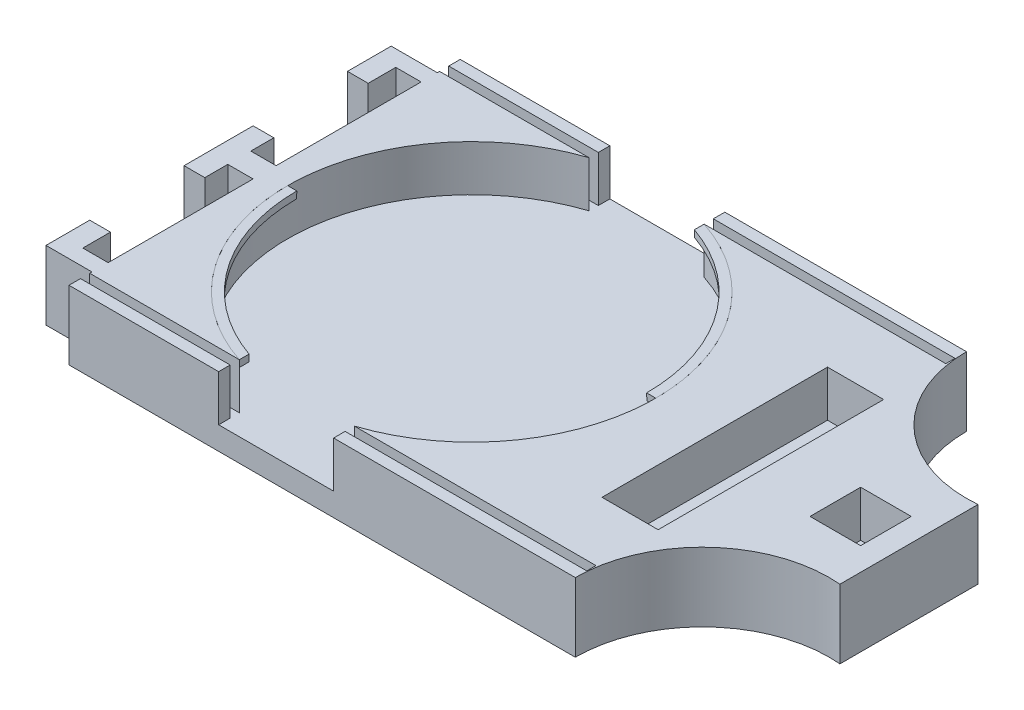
ISO-10303-21;
HEADER;
FILE_DESCRIPTION(('STEP AP214'),'2;1');
FILE_NAME('part.step','',(''),(''),'','','');
FILE_SCHEMA(('AUTOMOTIVE_DESIGN { 1 0 10303 214 1 1 1 1 }'));
ENDSEC;
DATA;
#1=APPLICATION_CONTEXT('core data for automotive mechanical design processes');
#2=APPLICATION_PROTOCOL_DEFINITION('international standard','automotive_design',2000,#1);
#3=PRODUCT_CONTEXT('',#1,'mechanical');
#4=PRODUCT('Part','Part','',(#3));
#5=PRODUCT_RELATED_PRODUCT_CATEGORY('part','',(#4));
#6=PRODUCT_DEFINITION_FORMATION('','',#4);
#7=PRODUCT_DEFINITION_CONTEXT('part definition',#1,'design');
#8=PRODUCT_DEFINITION('design','',#6,#7);
#9=PRODUCT_DEFINITION_SHAPE('','',#8);
#10=(LENGTH_UNIT() NAMED_UNIT(*) SI_UNIT(.MILLI.,.METRE.));
#11=(NAMED_UNIT(*) PLANE_ANGLE_UNIT() SI_UNIT($,.RADIAN.));
#12=(NAMED_UNIT(*) SI_UNIT($,.STERADIAN.) SOLID_ANGLE_UNIT());
#13=UNCERTAINTY_MEASURE_WITH_UNIT(LENGTH_MEASURE(1.E-05),#10,'distance_accuracy_value','');
#14=(GEOMETRIC_REPRESENTATION_CONTEXT(3) GLOBAL_UNCERTAINTY_ASSIGNED_CONTEXT((#13)) GLOBAL_UNIT_ASSIGNED_CONTEXT((#10,
#11,#12)) REPRESENTATION_CONTEXT('',''));
#15=CARTESIAN_POINT('',(0.,0.,0.));
#16=DIRECTION('',(0.,0.,1.));
#17=DIRECTION('',(1.,0.,0.));
#18=AXIS2_PLACEMENT_3D('',#15,#16,#17);
#19=CARTESIAN_POINT('',(55.,15.,42.5));
#20=DIRECTION('',(0.,1.,0.));
#21=DIRECTION('',(0.,0.,1.));
#22=AXIS2_PLACEMENT_3D('',#19,#20,#21);
#23=CONICAL_SURFACE('',#22,40.,0.0174532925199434);
#24=CARTESIAN_POINT('',(55.,15.,42.5));
#25=DIRECTION('',(0.,1.,0.));
#26=DIRECTION('',(0.,0.,1.));
#27=AXIS2_PLACEMENT_3D('',#24,#25,#26);
#28=CIRCLE('',#27,40.);
#29=CARTESIAN_POINT('',(15.,15.,42.5));
#30=VERTEX_POINT('',#29);
#31=CARTESIAN_POINT('',(42.5100040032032,15.,80.5));
#32=VERTEX_POINT('',#31);
#33=EDGE_CURVE('E94',#30,#32,#28,.T.);
#34=ORIENTED_EDGE('',*,*,#33,.F.);
#35=CARTESIAN_POINT('',(15.026191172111,13.5,42.5261825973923));
#36=CARTESIAN_POINT('',(15.021824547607,13.7499999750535,42.5218188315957));
#37=CARTESIAN_POINT('',(15.0174586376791,13.9999999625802,42.5174550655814));
#38=CARTESIAN_POINT('',(15.0087282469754,14.4999999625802,42.5087275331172));
#39=CARTESIAN_POINT('',(15.0043637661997,14.7499999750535,42.5043637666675));
#40=CARTESIAN_POINT('',(15.,15.,42.5));
#41=B_SPLINE_CURVE_WITH_KNOTS('',3,(#35,#36,#37,#38,#39,#40),.UNSPECIFIED.,.F.,.F.,(4,2,4),(0.,
0.750228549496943,1.50045709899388),.UNSPECIFIED.);
#42=CARTESIAN_POINT('',(15.026191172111,13.5,42.5261825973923));
#43=VERTEX_POINT('',#42);
#44=EDGE_CURVE('E12',#43,#30,#41,.T.);
#45=ORIENTED_EDGE('',*,*,#44,.F.);
#46=CARTESIAN_POINT('',(55.,13.5,42.5));
#47=DIRECTION('',(0.,1.,0.));
#48=DIRECTION('',(0.,0.,1.));
#49=AXIS2_PLACEMENT_3D('',#46,#47,#48);
#50=CIRCLE('',#49,39.9738174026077);
#51=CARTESIAN_POINT('',(42.4838214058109,13.5,80.4638163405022));
#52=VERTEX_POINT('',#51);
#53=EDGE_CURVE('E96',#43,#52,#50,.T.);
#54=ORIENTED_EDGE('',*,*,#53,.T.);
#55=CARTESIAN_POINT('',(42.4838214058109,13.5,80.4638163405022));
#56=CARTESIAN_POINT('',(42.4881851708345,13.7499999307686,80.469849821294));
#57=CARTESIAN_POINT('',(42.4925489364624,13.9999998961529,80.4758818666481));
#58=CARTESIAN_POINT('',(42.5012764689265,14.4999998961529,80.4879430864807));
#59=CARTESIAN_POINT('',(42.5056402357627,14.7499999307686,80.4939722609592));
#60=CARTESIAN_POINT('',(42.5100040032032,15.,80.5));
#61=B_SPLINE_CURVE_WITH_KNOTS('',3,(#55,#56,#57,#58,#59,#60),.UNSPECIFIED.,.F.,.F.,(4,2,4),(0.,
0.750332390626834,1.50066478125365),.UNSPECIFIED.);
#62=EDGE_CURVE('E81',#52,#32,#61,.T.);
#63=ORIENTED_EDGE('',*,*,#62,.T.);
#64=EDGE_LOOP('',(#34,#45,#54,#63));
#65=FACE_BOUND('',#64,.T.);
#66=ADVANCED_FACE('F43',(#65),#23,.T.);
#67=CARTESIAN_POINT('',(17.,15.,42.5));
#68=DIRECTION('',(0.,-0.0174524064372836,-0.999847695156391));
#69=DIRECTION('',(0.,0.999847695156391,-0.0174524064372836));
#70=AXIS2_PLACEMENT_3D('',#67,#68,#69);
#71=PLANE('',#70);
#72=DIRECTION('',(-1.,0.,0.));
#73=VECTOR('',#72,1.);
#74=CARTESIAN_POINT('',(17.,15.,42.5));
#75=LINE('',#74,#73);
#76=CARTESIAN_POINT('',(17.,15.,42.5));
#77=VERTEX_POINT('',#76);
#78=EDGE_CURVE('E106',#77,#30,#75,.T.);
#79=ORIENTED_EDGE('',*,*,#78,.F.);
#80=CARTESIAN_POINT('',(16.9738264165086,13.5,42.5261825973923));
#81=CARTESIAN_POINT('',(16.9781871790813,13.750000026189,42.5218188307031));
#82=CARTESIAN_POINT('',(16.9825486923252,14.0000000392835,42.5174550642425));
#83=CARTESIAN_POINT('',(16.9912732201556,14.5000000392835,42.5087275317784));
#84=CARTESIAN_POINT('',(16.9956362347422,14.750000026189,42.5043637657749));
#85=CARTESIAN_POINT('',(17.,15.,42.5));
#86=B_SPLINE_CURVE_WITH_KNOTS('',3,(#80,#81,#82,#83,#84,#85),.UNSPECIFIED.,.F.,.F.,(4,2,4),(0.,
0.750228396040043,1.50045679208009),.UNSPECIFIED.);
#87=CARTESIAN_POINT('',(16.9738264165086,13.5,42.5261825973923));
#88=VERTEX_POINT('',#87);
#89=EDGE_CURVE('E54',#88,#77,#86,.T.);
#90=ORIENTED_EDGE('',*,*,#89,.F.);
#91=DIRECTION('',(-1.,0.,0.));
#92=VECTOR('',#91,1.);
#93=CARTESIAN_POINT('',(55.,13.5,42.5261825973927));
#94=LINE('',#93,#92);
#95=EDGE_CURVE('E97',#88,#43,#94,.T.);
#96=ORIENTED_EDGE('',*,*,#95,.T.);
#97=ORIENTED_EDGE('',*,*,#44,.T.);
#98=EDGE_LOOP('',(#79,#90,#96,#97));
#99=FACE_BOUND('',#98,.T.);
#100=ADVANCED_FACE('F119',(#99),#71,.T.);
#101=CARTESIAN_POINT('',(55.,15.,42.5));
#102=DIRECTION('',(0.,-1.,0.));
#103=DIRECTION('',(0.,0.,1.));
#104=AXIS2_PLACEMENT_3D('',#101,#102,#103);
#105=CONICAL_SURFACE('',#104,38.,0.0174532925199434);
#106=CARTESIAN_POINT('',(55.,15.,42.5));
#107=DIRECTION('',(0.,-1.,0.));
#108=DIRECTION('',(0.,0.,1.));
#109=AXIS2_PLACEMENT_3D('',#106,#107,#108);
#110=CIRCLE('',#109,38.);
#111=CARTESIAN_POINT('',(42.5100040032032,15.,78.3887168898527));
#112=VERTEX_POINT('',#111);
#113=EDGE_CURVE('E103',#112,#77,#110,.T.);
#114=ORIENTED_EDGE('',*,*,#113,.F.);
#115=CARTESIAN_POINT('',(42.4838214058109,13.5,78.4073228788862));
#116=CARTESIAN_POINT('',(42.4881851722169,13.7500000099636,78.404222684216));
#117=CARTESIAN_POINT('',(42.4925489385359,14.0000000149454,78.4011220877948));
#118=CARTESIAN_POINT('',(42.501276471,14.5000000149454,78.3949200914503));
#119=CARTESIAN_POINT('',(42.5056402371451,14.7500000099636,78.391818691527));
#120=CARTESIAN_POINT('',(42.5100040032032,15.,78.3887168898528));
#121=B_SPLINE_CURVE_WITH_KNOTS('',3,(#115,#116,#117,#118,#119,#120),.UNSPECIFIED.,.F.,.F.,(4,2,
4),(0.,0.750171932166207,1.50034386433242),.UNSPECIFIED.);
#122=CARTESIAN_POINT('',(42.4838214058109,13.5,78.4073228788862));
#123=VERTEX_POINT('',#122);
#124=EDGE_CURVE('E74',#123,#112,#121,.T.);
#125=ORIENTED_EDGE('',*,*,#124,.F.);
#126=CARTESIAN_POINT('',(55.,13.5,42.5));
#127=DIRECTION('',(0.,1.,0.));
#128=DIRECTION('',(0.,0.,1.));
#129=AXIS2_PLACEMENT_3D('',#126,#127,#128);
#130=CIRCLE('',#129,38.0261825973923);
#131=EDGE_CURVE('E138',#123,#88,#130,.F.);
#132=ORIENTED_EDGE('',*,*,#131,.T.);
#133=ORIENTED_EDGE('',*,*,#89,.T.);
#134=EDGE_LOOP('',(#114,#125,#132,#133));
#135=FACE_BOUND('',#134,.T.);
#136=ADVANCED_FACE('F45',(#135),#105,.F.);
#137=CARTESIAN_POINT('',(42.5100040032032,15.,80.5));
#138=DIRECTION('',(0.999847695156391,-0.0174524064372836,0.));
#139=DIRECTION('',(0.0174524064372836,0.999847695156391,0.));
#140=AXIS2_PLACEMENT_3D('',#137,#138,#139);
#141=PLANE('',#140);
#142=DIRECTION('',(0.,0.,-1.));
#143=VECTOR('',#142,1.);
#144=CARTESIAN_POINT('',(42.5100040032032,15.,80.5));
#145=LINE('',#144,#143);
#146=EDGE_CURVE('E100',#32,#112,#145,.T.);
#147=ORIENTED_EDGE('',*,*,#146,.F.);
#148=ORIENTED_EDGE('',*,*,#62,.F.);
#149=DIRECTION('',(0.,0.,-1.));
#150=VECTOR('',#149,1.);
#151=CARTESIAN_POINT('',(42.4838214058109,13.5,42.5));
#152=LINE('',#151,#150);
#153=EDGE_CURVE('E48',#52,#123,#152,.T.);
#154=ORIENTED_EDGE('',*,*,#153,.T.);
#155=ORIENTED_EDGE('',*,*,#124,.T.);
#156=EDGE_LOOP('',(#147,#148,#154,#155));
#157=FACE_BOUND('',#156,.T.);
#158=ADVANCED_FACE('F101',(#157),#141,.T.);
#159=CARTESIAN_POINT('',(55.,13.5,42.5));
#160=DIRECTION('',(0.,1.,0.));
#161=DIRECTION('',(0.,0.,1.));
#162=AXIS2_PLACEMENT_3D('',#159,#160,#161);
#163=PLANE('',#162);
#164=ORIENTED_EDGE('',*,*,#53,.F.);
#165=ORIENTED_EDGE('',*,*,#95,.F.);
#166=ORIENTED_EDGE('',*,*,#131,.F.);
#167=ORIENTED_EDGE('',*,*,#153,.F.);
#168=EDGE_LOOP('',(#164,#165,#166,#167));
#169=FACE_BOUND('',#168,.T.);
#170=ADVANCED_FACE('F127',(#169),#163,.F.);
#171=CARTESIAN_POINT('',(55.,15.,42.5));
#172=DIRECTION('',(0.,1.,0.));
#173=DIRECTION('',(0.,0.,1.));
#174=AXIS2_PLACEMENT_3D('',#171,#172,#173);
#175=PLANE('',#174);
#176=ORIENTED_EDGE('',*,*,#33,.T.);
#177=ORIENTED_EDGE('',*,*,#146,.T.);
#178=ORIENTED_EDGE('',*,*,#113,.T.);
#179=ORIENTED_EDGE('',*,*,#78,.T.);
#180=EDGE_LOOP('',(#176,#177,#178,#179));
#181=FACE_BOUND('',#180,.T.);
#182=ADVANCED_FACE('F105',(#181),#175,.T.);
#183=CLOSED_SHELL('',(#66,#100,#136,#158,#170,#182));
#184=MANIFOLD_SOLID_BREP('B2',#183);
#185=CARTESIAN_POINT('',(55.,15.,42.5));
#186=DIRECTION('',(0.,1.,0.));
#187=DIRECTION('',(0.,0.,1.));
#188=AXIS2_PLACEMENT_3D('',#185,#186,#187);
#189=CONICAL_SURFACE('',#188,40.,0.0174532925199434);
#190=CARTESIAN_POINT('',(55.,15.,42.5));
#191=DIRECTION('',(0.,1.,0.));
#192=DIRECTION('',(0.,0.,1.));
#193=AXIS2_PLACEMENT_3D('',#190,#191,#192);
#194=CIRCLE('',#193,40.);
#195=CARTESIAN_POINT('',(95.,15.,42.5));
#196=VERTEX_POINT('',#195);
#197=CARTESIAN_POINT('',(67.4899959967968,15.,4.5));
#198=VERTEX_POINT('',#197);
#199=EDGE_CURVE('E246',#196,#198,#194,.T.);
#200=ORIENTED_EDGE('',*,*,#199,.F.);
#201=CARTESIAN_POINT('',(94.9738088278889,13.5,42.4738174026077));
#202=CARTESIAN_POINT('',(94.978175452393,13.7499999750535,42.4781811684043));
#203=CARTESIAN_POINT('',(94.9825413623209,13.9999999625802,42.4825449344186));
#204=CARTESIAN_POINT('',(94.9912717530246,14.4999999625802,42.4912724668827));
#205=CARTESIAN_POINT('',(94.9956362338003,14.7499999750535,42.4956362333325));
#206=CARTESIAN_POINT('',(95.,15.,42.5));
#207=B_SPLINE_CURVE_WITH_KNOTS('',3,(#201,#202,#203,#204,#205,#206),.UNSPECIFIED.,.F.,.F.,(4,2,
4),(0.,0.750228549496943,1.50045709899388),.UNSPECIFIED.);
#208=CARTESIAN_POINT('',(94.9738088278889,13.5,42.4738174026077));
#209=VERTEX_POINT('',#208);
#210=EDGE_CURVE('E41',#209,#196,#207,.T.);
#211=ORIENTED_EDGE('',*,*,#210,.F.);
#212=CARTESIAN_POINT('',(55.,13.5,42.5));
#213=DIRECTION('',(0.,1.,0.));
#214=DIRECTION('',(0.,0.,1.));
#215=AXIS2_PLACEMENT_3D('',#212,#213,#214);
#216=CIRCLE('',#215,39.9738174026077);
#217=CARTESIAN_POINT('',(67.5161785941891,13.5,4.53618365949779));
#218=VERTEX_POINT('',#217);
#219=EDGE_CURVE('E248',#209,#218,#216,.T.);
#220=ORIENTED_EDGE('',*,*,#219,.T.);
#221=CARTESIAN_POINT('',(67.5161785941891,13.5,4.53618365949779));
#222=CARTESIAN_POINT('',(67.5118148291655,13.7499999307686,4.53015017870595));
#223=CARTESIAN_POINT('',(67.5074510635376,13.9999998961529,4.52411813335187));
#224=CARTESIAN_POINT('',(67.4987235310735,14.4999998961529,4.51205691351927));
#225=CARTESIAN_POINT('',(67.4943597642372,14.7499999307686,4.50602773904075));
#226=CARTESIAN_POINT('',(67.4899959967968,15.,4.49999999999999));
#227=B_SPLINE_CURVE_WITH_KNOTS('',3,(#221,#222,#223,#224,#225,#226),.UNSPECIFIED.,.F.,.F.,(4,2,
4),(0.,0.750332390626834,1.50066478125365),.UNSPECIFIED.);
#228=EDGE_CURVE('E233',#218,#198,#227,.T.);
#229=ORIENTED_EDGE('',*,*,#228,.T.);
#230=EDGE_LOOP('',(#200,#211,#220,#229));
#231=FACE_BOUND('',#230,.T.);
#232=ADVANCED_FACE('F195',(#231),#189,.T.);
#233=CARTESIAN_POINT('',(93.,15.,42.5));
#234=DIRECTION('',(0.,-0.0174524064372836,0.999847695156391));
#235=DIRECTION('',(0.,-0.999847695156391,-0.0174524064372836));
#236=AXIS2_PLACEMENT_3D('',#233,#234,#235);
#237=PLANE('',#236);
#238=DIRECTION('',(1.,0.,0.));
#239=VECTOR('',#238,1.);
#240=CARTESIAN_POINT('',(93.,15.,42.5));
#241=LINE('',#240,#239);
#242=CARTESIAN_POINT('',(93.,15.,42.5));
#243=VERTEX_POINT('',#242);
#244=EDGE_CURVE('E258',#243,#196,#241,.T.);
#245=ORIENTED_EDGE('',*,*,#244,.F.);
#246=CARTESIAN_POINT('',(93.0261735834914,13.5,42.4738174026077));
#247=CARTESIAN_POINT('',(93.0218128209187,13.750000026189,42.4781811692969));
#248=CARTESIAN_POINT('',(93.0174513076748,14.0000000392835,42.4825449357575));
#249=CARTESIAN_POINT('',(93.0087267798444,14.5000000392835,42.4912724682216));
#250=CARTESIAN_POINT('',(93.0043637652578,14.750000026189,42.4956362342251));
#251=CARTESIAN_POINT('',(93.,15.,42.5));
#252=B_SPLINE_CURVE_WITH_KNOTS('',3,(#246,#247,#248,#249,#250,#251),.UNSPECIFIED.,.F.,.F.,(4,2,
4),(0.,0.750228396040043,1.50045679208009),.UNSPECIFIED.);
#253=CARTESIAN_POINT('',(93.0261735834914,13.5,42.4738174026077));
#254=VERTEX_POINT('',#253);
#255=EDGE_CURVE('E206',#254,#243,#252,.T.);
#256=ORIENTED_EDGE('',*,*,#255,.F.);
#257=DIRECTION('',(1.,0.,0.));
#258=VECTOR('',#257,1.);
#259=CARTESIAN_POINT('',(55.,13.5,42.4738174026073));
#260=LINE('',#259,#258);
#261=EDGE_CURVE('E249',#254,#209,#260,.T.);
#262=ORIENTED_EDGE('',*,*,#261,.T.);
#263=ORIENTED_EDGE('',*,*,#210,.T.);
#264=EDGE_LOOP('',(#245,#256,#262,#263));
#265=FACE_BOUND('',#264,.T.);
#266=ADVANCED_FACE('F271',(#265),#237,.T.);
#267=CARTESIAN_POINT('',(55.,15.,42.5));
#268=DIRECTION('',(0.,-1.,0.));
#269=DIRECTION('',(0.,0.,1.));
#270=AXIS2_PLACEMENT_3D('',#267,#268,#269);
#271=CONICAL_SURFACE('',#270,38.,0.0174532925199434);
#272=CARTESIAN_POINT('',(55.,15.,42.5));
#273=DIRECTION('',(0.,-1.,0.));
#274=DIRECTION('',(0.,0.,1.));
#275=AXIS2_PLACEMENT_3D('',#272,#273,#274);
#276=CIRCLE('',#275,38.);
#277=CARTESIAN_POINT('',(67.4899959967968,15.,6.61128311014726));
#278=VERTEX_POINT('',#277);
#279=EDGE_CURVE('E255',#278,#243,#276,.T.);
#280=ORIENTED_EDGE('',*,*,#279,.F.);
#281=CARTESIAN_POINT('',(67.5161785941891,13.5,6.59267712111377));
#282=CARTESIAN_POINT('',(67.5118148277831,13.7500000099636,6.59577731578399));
#283=CARTESIAN_POINT('',(67.5074510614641,14.0000000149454,6.59887791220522));
#284=CARTESIAN_POINT('',(67.498723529,14.5000000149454,6.60507990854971));
#285=CARTESIAN_POINT('',(67.4943597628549,14.7500000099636,6.60818130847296));
#286=CARTESIAN_POINT('',(67.4899959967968,15.,6.61128311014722));
#287=B_SPLINE_CURVE_WITH_KNOTS('',3,(#281,#282,#283,#284,#285,#286),.UNSPECIFIED.,.F.,.F.,(4,2,
4),(0.,0.750171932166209,1.50034386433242),.UNSPECIFIED.);
#288=CARTESIAN_POINT('',(67.5161785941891,13.5,6.59267712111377));
#289=VERTEX_POINT('',#288);
#290=EDGE_CURVE('E226',#289,#278,#287,.T.);
#291=ORIENTED_EDGE('',*,*,#290,.F.);
#292=CARTESIAN_POINT('',(55.,13.5,42.5));
#293=DIRECTION('',(0.,1.,0.));
#294=DIRECTION('',(0.,0.,1.));
#295=AXIS2_PLACEMENT_3D('',#292,#293,#294);
#296=CIRCLE('',#295,38.0261825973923);
#297=EDGE_CURVE('E290',#289,#254,#296,.F.);
#298=ORIENTED_EDGE('',*,*,#297,.T.);
#299=ORIENTED_EDGE('',*,*,#255,.T.);
#300=EDGE_LOOP('',(#280,#291,#298,#299));
#301=FACE_BOUND('',#300,.T.);
#302=ADVANCED_FACE('F197',(#301),#271,.F.);
#303=CARTESIAN_POINT('',(67.4899959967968,15.,4.5));
#304=DIRECTION('',(-0.999847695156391,-0.0174524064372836,0.));
#305=DIRECTION('',(0.0174524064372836,-0.999847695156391,0.));
#306=AXIS2_PLACEMENT_3D('',#303,#304,#305);
#307=PLANE('',#306);
#308=DIRECTION('',(0.,0.,1.));
#309=VECTOR('',#308,1.);
#310=CARTESIAN_POINT('',(67.4899959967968,15.,4.5));
#311=LINE('',#310,#309);
#312=EDGE_CURVE('E252',#198,#278,#311,.T.);
#313=ORIENTED_EDGE('',*,*,#312,.F.);
#314=ORIENTED_EDGE('',*,*,#228,.F.);
#315=DIRECTION('',(0.,0.,1.));
#316=VECTOR('',#315,1.);
#317=CARTESIAN_POINT('',(67.5161785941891,13.5,42.5));
#318=LINE('',#317,#316);
#319=EDGE_CURVE('E200',#218,#289,#318,.T.);
#320=ORIENTED_EDGE('',*,*,#319,.T.);
#321=ORIENTED_EDGE('',*,*,#290,.T.);
#322=EDGE_LOOP('',(#313,#314,#320,#321));
#323=FACE_BOUND('',#322,.T.);
#324=ADVANCED_FACE('F253',(#323),#307,.T.);
#325=CARTESIAN_POINT('',(55.,13.5,42.5));
#326=DIRECTION('',(0.,1.,0.));
#327=DIRECTION('',(0.,0.,1.));
#328=AXIS2_PLACEMENT_3D('',#325,#326,#327);
#329=PLANE('',#328);
#330=ORIENTED_EDGE('',*,*,#219,.F.);
#331=ORIENTED_EDGE('',*,*,#261,.F.);
#332=ORIENTED_EDGE('',*,*,#297,.F.);
#333=ORIENTED_EDGE('',*,*,#319,.F.);
#334=EDGE_LOOP('',(#330,#331,#332,#333));
#335=FACE_BOUND('',#334,.T.);
#336=ADVANCED_FACE('F279',(#335),#329,.F.);
#337=CARTESIAN_POINT('',(55.,15.,42.5));
#338=DIRECTION('',(0.,1.,0.));
#339=DIRECTION('',(0.,0.,1.));
#340=AXIS2_PLACEMENT_3D('',#337,#338,#339);
#341=PLANE('',#340);
#342=ORIENTED_EDGE('',*,*,#199,.T.);
#343=ORIENTED_EDGE('',*,*,#312,.T.);
#344=ORIENTED_EDGE('',*,*,#279,.T.);
#345=ORIENTED_EDGE('',*,*,#244,.T.);
#346=EDGE_LOOP('',(#342,#343,#344,#345));
#347=FACE_BOUND('',#346,.T.);
#348=ADVANCED_FACE('F257',(#347),#341,.T.);
#349=CLOSED_SHELL('',(#232,#266,#302,#324,#336,#348));
#350=MANIFOLD_SOLID_BREP('B6',#349);
#351=CARTESIAN_POINT('',(147.604166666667,15.,0.));
#352=DIRECTION('',(0.,1.,0.));
#353=DIRECTION('',(0.,0.,1.));
#354=AXIS2_PLACEMENT_3D('',#351,#352,#353);
#355=PLANE('',#354);
#356=DIRECTION('',(-1.,0.,0.));
#357=VECTOR('',#356,1.);
#358=CARTESIAN_POINT('',(10.,15.,80.5));
#359=LINE('',#358,#357);
#360=CARTESIAN_POINT('',(42.5100040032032,15.,80.5));
#361=VERTEX_POINT('',#360);
#362=CARTESIAN_POINT('',(10.,15.,80.5));
#363=VERTEX_POINT('',#362);
#364=EDGE_CURVE('E751',#361,#363,#359,.T.);
#365=ORIENTED_EDGE('',*,*,#364,.F.);
#366=CARTESIAN_POINT('',(55.,15.,42.5));
#367=DIRECTION('',(0.,1.,0.));
#368=DIRECTION('',(0.,0.,1.));
#369=AXIS2_PLACEMENT_3D('',#366,#367,#368);
#370=CIRCLE('',#369,40.);
#371=CARTESIAN_POINT('',(42.5100040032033,15.,4.5));
#372=VERTEX_POINT('',#371);
#373=EDGE_CURVE('E846',#372,#361,#370,.T.);
#374=ORIENTED_EDGE('',*,*,#373,.F.);
#375=DIRECTION('',(1.,0.,0.));
#376=VECTOR('',#375,1.);
#377=CARTESIAN_POINT('',(10.,15.,4.5));
#378=LINE('',#377,#376);
#379=CARTESIAN_POINT('',(10.,15.,4.5));
#380=VERTEX_POINT('',#379);
#381=EDGE_CURVE('E843',#380,#372,#378,.T.);
#382=ORIENTED_EDGE('',*,*,#381,.F.);
#383=DIRECTION('',(0.,0.,1.));
#384=VECTOR('',#383,1.);
#385=CARTESIAN_POINT('',(10.,15.,0.));
#386=LINE('',#385,#384);
#387=CARTESIAN_POINT('',(10.,15.,5.));
#388=VERTEX_POINT('',#387);
#389=EDGE_CURVE('E925',#380,#388,#386,.T.);
#390=ORIENTED_EDGE('',*,*,#389,.T.);
#391=DIRECTION('',(-1.,0.,0.));
#392=VECTOR('',#391,1.);
#393=CARTESIAN_POINT('',(10.,15.,5.));
#394=LINE('',#393,#392);
#395=CARTESIAN_POINT('',(0.,15.,5.));
#396=VERTEX_POINT('',#395);
#397=EDGE_CURVE('E929',#388,#396,#394,.T.);
#398=ORIENTED_EDGE('',*,*,#397,.T.);
#399=DIRECTION('',(0.,0.,1.));
#400=VECTOR('',#399,1.);
#401=CARTESIAN_POINT('',(0.,15.,5.));
#402=LINE('',#401,#400);
#403=CARTESIAN_POINT('',(0.,15.,14.5));
#404=VERTEX_POINT('',#403);
#405=EDGE_CURVE('E931',#396,#404,#402,.T.);
#406=ORIENTED_EDGE('',*,*,#405,.T.);
#407=DIRECTION('',(1.,0.,0.));
#408=VECTOR('',#407,1.);
#409=CARTESIAN_POINT('',(0.,15.,14.5));
#410=LINE('',#409,#408);
#411=CARTESIAN_POINT('',(4.50000000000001,15.,14.5));
#412=VERTEX_POINT('',#411);
#413=EDGE_CURVE('E933',#404,#412,#410,.T.);
#414=ORIENTED_EDGE('',*,*,#413,.T.);
#415=DIRECTION('',(0.,0.,-1.));
#416=VECTOR('',#415,1.);
#417=CARTESIAN_POINT('',(4.50000000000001,15.,14.5));
#418=LINE('',#417,#416);
#419=CARTESIAN_POINT('',(4.50000000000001,15.,8.5));
#420=VERTEX_POINT('',#419);
#421=EDGE_CURVE('E935',#412,#420,#418,.T.);
#422=ORIENTED_EDGE('',*,*,#421,.T.);
#423=DIRECTION('',(1.,0.,0.));
#424=VECTOR('',#423,1.);
#425=CARTESIAN_POINT('',(4.50000000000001,15.,8.5));
#426=LINE('',#425,#424);
#427=CARTESIAN_POINT('',(10.,15.,8.5));
#428=VERTEX_POINT('',#427);
#429=EDGE_CURVE('E937',#420,#428,#426,.T.);
#430=ORIENTED_EDGE('',*,*,#429,.T.);
#431=DIRECTION('',(0.,0.,1.));
#432=VECTOR('',#431,1.);
#433=CARTESIAN_POINT('',(10.,15.,8.5));
#434=LINE('',#433,#432);
#435=CARTESIAN_POINT('',(10.,15.,40.));
#436=VERTEX_POINT('',#435);
#437=EDGE_CURVE('E939',#428,#436,#434,.T.);
#438=ORIENTED_EDGE('',*,*,#437,.T.);
#439=DIRECTION('',(-1.,0.,0.));
#440=VECTOR('',#439,1.);
#441=CARTESIAN_POINT('',(10.,15.,40.));
#442=LINE('',#441,#440);
#443=CARTESIAN_POINT('',(4.50000000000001,15.,40.));
#444=VERTEX_POINT('',#443);
#445=EDGE_CURVE('E941',#436,#444,#442,.T.);
#446=ORIENTED_EDGE('',*,*,#445,.T.);
#447=DIRECTION('',(0.,0.,-1.));
#448=VECTOR('',#447,1.);
#449=CARTESIAN_POINT('',(4.50000000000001,15.,40.));
#450=LINE('',#449,#448);
#451=CARTESIAN_POINT('',(4.50000000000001,15.,35.));
#452=VERTEX_POINT('',#451);
#453=EDGE_CURVE('E943',#444,#452,#450,.T.);
#454=ORIENTED_EDGE('',*,*,#453,.T.);
#455=DIRECTION('',(-1.,0.,0.));
#456=VECTOR('',#455,1.);
#457=CARTESIAN_POINT('',(0.,15.,35.));
#458=LINE('',#457,#456);
#459=CARTESIAN_POINT('',(0.,15.,35.));
#460=VERTEX_POINT('',#459);
#461=EDGE_CURVE('E945',#452,#460,#458,.T.);
#462=ORIENTED_EDGE('',*,*,#461,.T.);
#463=DIRECTION('',(0.,0.,1.));
#464=VECTOR('',#463,1.);
#465=CARTESIAN_POINT('',(0.,15.,50.));
#466=LINE('',#465,#464);
#467=CARTESIAN_POINT('',(0.,15.,50.));
#468=VERTEX_POINT('',#467);
#469=EDGE_CURVE('E947',#460,#468,#466,.T.);
#470=ORIENTED_EDGE('',*,*,#469,.T.);
#471=DIRECTION('',(1.,0.,0.));
#472=VECTOR('',#471,1.);
#473=CARTESIAN_POINT('',(4.50000000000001,15.,50.));
#474=LINE('',#473,#472);
#475=CARTESIAN_POINT('',(4.50000000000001,15.,50.));
#476=VERTEX_POINT('',#475);
#477=EDGE_CURVE('E949',#468,#476,#474,.T.);
#478=ORIENTED_EDGE('',*,*,#477,.T.);
#479=DIRECTION('',(0.,0.,-1.));
#480=VECTOR('',#479,1.);
#481=CARTESIAN_POINT('',(4.50000000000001,15.,45.));
#482=LINE('',#481,#480);
#483=CARTESIAN_POINT('',(4.50000000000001,15.,45.));
#484=VERTEX_POINT('',#483);
#485=EDGE_CURVE('E951',#476,#484,#482,.T.);
#486=ORIENTED_EDGE('',*,*,#485,.T.);
#487=DIRECTION('',(1.,0.,0.));
#488=VECTOR('',#487,1.);
#489=CARTESIAN_POINT('',(10.,15.,45.));
#490=LINE('',#489,#488);
#491=CARTESIAN_POINT('',(10.,15.,45.));
#492=VERTEX_POINT('',#491);
#493=EDGE_CURVE('E953',#484,#492,#490,.T.);
#494=ORIENTED_EDGE('',*,*,#493,.T.);
#495=DIRECTION('',(0.,0.,1.));
#496=VECTOR('',#495,1.);
#497=CARTESIAN_POINT('',(10.,15.,76.5));
#498=LINE('',#497,#496);
#499=CARTESIAN_POINT('',(10.,15.,76.5));
#500=VERTEX_POINT('',#499);
#501=EDGE_CURVE('E955',#492,#500,#498,.T.);
#502=ORIENTED_EDGE('',*,*,#501,.T.);
#503=DIRECTION('',(-1.,0.,0.));
#504=VECTOR('',#503,1.);
#505=CARTESIAN_POINT('',(4.50000000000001,15.,76.5));
#506=LINE('',#505,#504);
#507=CARTESIAN_POINT('',(4.50000000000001,15.,76.5));
#508=VERTEX_POINT('',#507);
#509=EDGE_CURVE('E895',#500,#508,#506,.T.);
#510=ORIENTED_EDGE('',*,*,#509,.T.);
#511=DIRECTION('',(0.,0.,-1.));
#512=VECTOR('',#511,1.);
#513=CARTESIAN_POINT('',(4.50000000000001,15.,70.5));
#514=LINE('',#513,#512);
#515=CARTESIAN_POINT('',(4.50000000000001,15.,70.5));
#516=VERTEX_POINT('',#515);
#517=EDGE_CURVE('E898',#508,#516,#514,.T.);
#518=ORIENTED_EDGE('',*,*,#517,.T.);
#519=DIRECTION('',(-1.,0.,0.));
#520=VECTOR('',#519,1.);
#521=CARTESIAN_POINT('',(0.,15.,70.5));
#522=LINE('',#521,#520);
#523=CARTESIAN_POINT('',(0.,15.,70.5));
#524=VERTEX_POINT('',#523);
#525=EDGE_CURVE('E901',#516,#524,#522,.T.);
#526=ORIENTED_EDGE('',*,*,#525,.T.);
#527=DIRECTION('',(0.,0.,1.));
#528=VECTOR('',#527,1.);
#529=CARTESIAN_POINT('',(0.,15.,80.));
#530=LINE('',#529,#528);
#531=CARTESIAN_POINT('',(0.,15.,80.));
#532=VERTEX_POINT('',#531);
#533=EDGE_CURVE('E903',#524,#532,#530,.T.);
#534=ORIENTED_EDGE('',*,*,#533,.T.);
#535=DIRECTION('',(1.,0.,0.));
#536=VECTOR('',#535,1.);
#537=CARTESIAN_POINT('',(10.,15.,80.));
#538=LINE('',#537,#536);
#539=CARTESIAN_POINT('',(10.,15.,80.));
#540=VERTEX_POINT('',#539);
#541=EDGE_CURVE('E905',#532,#540,#538,.T.);
#542=ORIENTED_EDGE('',*,*,#541,.T.);
#543=DIRECTION('',(0.,0.,1.));
#544=VECTOR('',#543,1.);
#545=CARTESIAN_POINT('',(10.,15.,85.));
#546=LINE('',#545,#544);
#547=EDGE_CURVE('E908',#540,#363,#546,.T.);
#548=ORIENTED_EDGE('',*,*,#547,.T.);
#549=EDGE_LOOP('',(#365,#374,#382,#390,#398,#406,#414,#422,#430,#438,#446,#454,#462,#470,#478,
#486,#494,#502,#510,#518,#526,#534,#542,#548));
#550=FACE_BOUND('',#549,.T.);
#551=ADVANCED_FACE('F338',(#550),#355,.T.);
#552=DIRECTION('',(-1.,0.,0.));
#553=VECTOR('',#552,1.);
#554=CARTESIAN_POINT('',(10.,15.,2.5));
#555=LINE('',#554,#553);
#556=CARTESIAN_POINT('',(42.5100040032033,15.,2.5));
#557=VERTEX_POINT('',#556);
#558=CARTESIAN_POINT('',(10.,15.,2.5));
#559=VERTEX_POINT('',#558);
#560=EDGE_CURVE('E841',#557,#559,#555,.T.);
#561=ORIENTED_EDGE('',*,*,#560,.F.);
#562=DIRECTION('',(0.,0.,1.));
#563=VECTOR('',#562,1.);
#564=CARTESIAN_POINT('',(42.5100040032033,15.,2.5));
#565=LINE('',#564,#563);
#566=CARTESIAN_POINT('',(42.5100040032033,15.,0.));
#567=VERTEX_POINT('',#566);
#568=EDGE_CURVE('E838',#567,#557,#565,.T.);
#569=ORIENTED_EDGE('',*,*,#568,.F.);
#570=DIRECTION('',(-1.,0.,0.));
#571=VECTOR('',#570,1.);
#572=CARTESIAN_POINT('',(10.,15.,0.));
#573=LINE('',#572,#571);
#574=CARTESIAN_POINT('',(10.,15.,0.));
#575=VERTEX_POINT('',#574);
#576=EDGE_CURVE('E921',#567,#575,#573,.T.);
#577=ORIENTED_EDGE('',*,*,#576,.T.);
#578=EDGE_CURVE('E926',#575,#559,#386,.T.);
#579=ORIENTED_EDGE('',*,*,#578,.T.);
#580=EDGE_LOOP('',(#561,#569,#577,#579));
#581=FACE_BOUND('',#580,.T.);
#582=ADVANCED_FACE('F1238',(#581),#355,.T.);
#583=DIRECTION('',(0.,0.,-1.));
#584=VECTOR('',#583,1.);
#585=CARTESIAN_POINT('',(120.,15.,42.5));
#586=LINE('',#585,#584);
#587=CARTESIAN_POINT('',(120.,15.,67.));
#588=VERTEX_POINT('',#587);
#589=CARTESIAN_POINT('',(120.,15.,18.));
#590=VERTEX_POINT('',#589);
#591=EDGE_CURVE('E683',#588,#590,#586,.T.);
#592=ORIENTED_EDGE('',*,*,#591,.F.);
#593=DIRECTION('',(1.,0.,0.));
#594=VECTOR('',#593,1.);
#595=CARTESIAN_POINT('',(120.,15.,67.));
#596=LINE('',#595,#594);
#597=CARTESIAN_POINT('',(107.8,15.,67.));
#598=VERTEX_POINT('',#597);
#599=EDGE_CURVE('E700',#598,#588,#596,.T.);
#600=ORIENTED_EDGE('',*,*,#599,.F.);
#601=DIRECTION('',(0.,0.,1.));
#602=VECTOR('',#601,1.);
#603=CARTESIAN_POINT('',(107.8,15.,18.));
#604=LINE('',#603,#602);
#605=CARTESIAN_POINT('',(107.8,15.,18.));
#606=VERTEX_POINT('',#605);
#607=EDGE_CURVE('E707',#606,#598,#604,.T.);
#608=ORIENTED_EDGE('',*,*,#607,.F.);
#609=DIRECTION('',(-1.,0.,0.));
#610=VECTOR('',#609,1.);
#611=CARTESIAN_POINT('',(120.,15.,18.));
#612=LINE('',#611,#610);
#613=EDGE_CURVE('E705',#590,#606,#612,.T.);
#614=ORIENTED_EDGE('',*,*,#613,.F.);
#615=EDGE_LOOP('',(#592,#600,#608,#614));
#616=FACE_BOUND('',#615,.T.);
#617=DIRECTION('',(0.,0.,1.));
#618=VECTOR('',#617,1.);
#619=CARTESIAN_POINT('',(134.,15.,48.));
#620=LINE('',#619,#618);
#621=CARTESIAN_POINT('',(134.,15.,37.));
#622=VERTEX_POINT('',#621);
#623=CARTESIAN_POINT('',(134.,15.,48.));
#624=VERTEX_POINT('',#623);
#625=EDGE_CURVE('E361',#622,#624,#620,.T.);
#626=ORIENTED_EDGE('',*,*,#625,.F.);
#627=DIRECTION('',(-1.,0.,0.));
#628=VECTOR('',#627,1.);
#629=CARTESIAN_POINT('',(134.,15.,37.));
#630=LINE('',#629,#628);
#631=CARTESIAN_POINT('',(145.,15.,37.));
#632=VERTEX_POINT('',#631);
#633=EDGE_CURVE('E723',#632,#622,#630,.T.);
#634=ORIENTED_EDGE('',*,*,#633,.F.);
#635=DIRECTION('',(0.,0.,-1.));
#636=VECTOR('',#635,1.);
#637=CARTESIAN_POINT('',(145.,15.,42.5));
#638=LINE('',#637,#636);
#639=CARTESIAN_POINT('',(145.,15.,48.));
#640=VERTEX_POINT('',#639);
#641=EDGE_CURVE('E736',#640,#632,#638,.T.);
#642=ORIENTED_EDGE('',*,*,#641,.F.);
#643=DIRECTION('',(1.,0.,0.));
#644=VECTOR('',#643,1.);
#645=CARTESIAN_POINT('',(145.,15.,48.));
#646=LINE('',#645,#644);
#647=EDGE_CURVE('E733',#624,#640,#646,.T.);
#648=ORIENTED_EDGE('',*,*,#647,.F.);
#649=EDGE_LOOP('',(#626,#634,#642,#648));
#650=FACE_BOUND('',#649,.T.);
#651=DIRECTION('',(0.,0.,-1.));
#652=VECTOR('',#651,1.);
#653=CARTESIAN_POINT('',(67.4899959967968,15.,0.));
#654=LINE('',#653,#652);
#655=CARTESIAN_POINT('',(67.4899959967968,15.,2.5));
#656=VERTEX_POINT('',#655);
#657=CARTESIAN_POINT('',(67.4899959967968,15.,0.));
#658=VERTEX_POINT('',#657);
#659=EDGE_CURVE('E836',#656,#658,#654,.T.);
#660=ORIENTED_EDGE('',*,*,#659,.F.);
#661=DIRECTION('',(-1.,0.,0.));
#662=VECTOR('',#661,1.);
#663=CARTESIAN_POINT('',(67.4899959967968,15.,2.5));
#664=LINE('',#663,#662);
#665=CARTESIAN_POINT('',(120.,15.,2.5));
#666=VERTEX_POINT('',#665);
#667=EDGE_CURVE('E833',#666,#656,#664,.T.);
#668=ORIENTED_EDGE('',*,*,#667,.F.);
#669=DIRECTION('',(0.,0.,-1.));
#670=VECTOR('',#669,1.);
#671=CARTESIAN_POINT('',(120.,15.,4.5));
#672=LINE('',#671,#670);
#673=CARTESIAN_POINT('',(120.,15.,4.5));
#674=VERTEX_POINT('',#673);
#675=EDGE_CURVE('E830',#674,#666,#672,.T.);
#676=ORIENTED_EDGE('',*,*,#675,.F.);
#677=DIRECTION('',(1.,0.,0.));
#678=VECTOR('',#677,1.);
#679=CARTESIAN_POINT('',(67.4899959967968,15.,4.5));
#680=LINE('',#679,#678);
#681=CARTESIAN_POINT('',(67.4899959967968,15.,4.5));
#682=VERTEX_POINT('',#681);
#683=EDGE_CURVE('E827',#682,#674,#680,.T.);
#684=ORIENTED_EDGE('',*,*,#683,.F.);
#685=CARTESIAN_POINT('',(55.,15.,42.5));
#686=DIRECTION('',(0.,1.,0.));
#687=DIRECTION('',(0.,0.,1.));
#688=AXIS2_PLACEMENT_3D('',#685,#686,#687);
#689=CIRCLE('',#688,40.);
#690=CARTESIAN_POINT('',(67.4899959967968,15.,80.5));
#691=VERTEX_POINT('',#690);
#692=EDGE_CURVE('E824',#691,#682,#689,.T.);
#693=ORIENTED_EDGE('',*,*,#692,.F.);
#694=DIRECTION('',(-1.,0.,0.));
#695=VECTOR('',#694,1.);
#696=CARTESIAN_POINT('',(67.4899959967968,15.,80.5));
#697=LINE('',#696,#695);
#698=CARTESIAN_POINT('',(120.,15.,80.5));
#699=VERTEX_POINT('',#698);
#700=EDGE_CURVE('E821',#699,#691,#697,.T.);
#701=ORIENTED_EDGE('',*,*,#700,.F.);
#702=DIRECTION('',(0.,0.,-1.));
#703=VECTOR('',#702,1.);
#704=CARTESIAN_POINT('',(120.,15.,80.5));
#705=LINE('',#704,#703);
#706=CARTESIAN_POINT('',(120.,15.,82.5));
#707=VERTEX_POINT('',#706);
#708=EDGE_CURVE('E818',#707,#699,#705,.T.);
#709=ORIENTED_EDGE('',*,*,#708,.F.);
#710=DIRECTION('',(1.,0.,0.));
#711=VECTOR('',#710,1.);
#712=CARTESIAN_POINT('',(67.4899959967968,15.,82.5));
#713=LINE('',#712,#711);
#714=CARTESIAN_POINT('',(67.4899959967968,15.,82.5));
#715=VERTEX_POINT('',#714);
#716=EDGE_CURVE('E815',#715,#707,#713,.T.);
#717=ORIENTED_EDGE('',*,*,#716,.F.);
#718=DIRECTION('',(0.,0.,-1.));
#719=VECTOR('',#718,1.);
#720=CARTESIAN_POINT('',(67.4899959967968,15.,82.5));
#721=LINE('',#720,#719);
#722=CARTESIAN_POINT('',(67.4899959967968,15.,85.));
#723=VERTEX_POINT('',#722);
#724=EDGE_CURVE('E812',#723,#715,#721,.T.);
#725=ORIENTED_EDGE('',*,*,#724,.F.);
#726=DIRECTION('',(1.,0.,0.));
#727=VECTOR('',#726,1.);
#728=CARTESIAN_POINT('',(10.,15.,85.));
#729=LINE('',#728,#727);
#730=CARTESIAN_POINT('',(120.,15.,85.));
#731=VERTEX_POINT('',#730);
#732=EDGE_CURVE('E911',#723,#731,#729,.T.);
#733=ORIENTED_EDGE('',*,*,#732,.T.);
#734=CARTESIAN_POINT('',(147.604166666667,15.,85.));
#735=DIRECTION('',(0.,-1.,0.));
#736=DIRECTION('',(0.,0.,-1.));
#737=AXIS2_PLACEMENT_3D('',#734,#735,#736);
#738=CIRCLE('',#737,27.6041666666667);
#739=CARTESIAN_POINT('',(150.,15.,57.5));
#740=VERTEX_POINT('',#739);
#741=EDGE_CURVE('E915',#731,#740,#738,.T.);
#742=ORIENTED_EDGE('',*,*,#741,.T.);
#743=DIRECTION('',(0.,0.,-1.));
#744=VECTOR('',#743,1.);
#745=CARTESIAN_POINT('',(150.,15.,42.5));
#746=LINE('',#745,#744);
#747=CARTESIAN_POINT('',(150.,15.,27.5));
#748=VERTEX_POINT('',#747);
#749=EDGE_CURVE('E917',#740,#748,#746,.T.);
#750=ORIENTED_EDGE('',*,*,#749,.T.);
#751=CARTESIAN_POINT('',(147.604166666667,15.,0.));
#752=DIRECTION('',(0.,-1.,0.));
#753=DIRECTION('',(0.,0.,1.));
#754=AXIS2_PLACEMENT_3D('',#751,#752,#753);
#755=CIRCLE('',#754,27.6041666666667);
#756=CARTESIAN_POINT('',(120.,15.,0.));
#757=VERTEX_POINT('',#756);
#758=EDGE_CURVE('E919',#748,#757,#755,.T.);
#759=ORIENTED_EDGE('',*,*,#758,.T.);
#760=EDGE_CURVE('E922',#757,#658,#573,.T.);
#761=ORIENTED_EDGE('',*,*,#760,.T.);
#762=EDGE_LOOP('',(#660,#668,#676,#684,#693,#701,#709,#717,#725,#733,#742,#750,#759,#761));
#763=FACE_BOUND('',#762,.T.);
#764=ADVANCED_FACE('F1249',(#616,#650,#763),#355,.T.);
#765=CARTESIAN_POINT('',(4.50000000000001,15.,76.5));
#766=DIRECTION('',(0.,0.,1.));
#767=DIRECTION('',(1.,0.,0.));
#768=AXIS2_PLACEMENT_3D('',#765,#766,#767);
#769=PLANE('',#768);
#770=DIRECTION('',(-1.,0.,0.));
#771=VECTOR('',#770,1.);
#772=CARTESIAN_POINT('',(4.50000000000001,0.,76.5));
#773=LINE('',#772,#771);
#774=CARTESIAN_POINT('',(10.,0.,76.5));
#775=VERTEX_POINT('',#774);
#776=CARTESIAN_POINT('',(4.50000000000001,0.,76.5));
#777=VERTEX_POINT('',#776);
#778=EDGE_CURVE('E852',#775,#777,#773,.T.);
#779=ORIENTED_EDGE('',*,*,#778,.T.);
#780=DIRECTION('',(0.,-1.,0.));
#781=VECTOR('',#780,1.);
#782=CARTESIAN_POINT('',(4.50000000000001,15.,76.5));
#783=LINE('',#782,#781);
#784=EDGE_CURVE('E193',#508,#777,#783,.T.);
#785=ORIENTED_EDGE('',*,*,#784,.F.);
#786=ORIENTED_EDGE('',*,*,#509,.F.);
#787=DIRECTION('',(0.,-1.,0.));
#788=VECTOR('',#787,1.);
#789=CARTESIAN_POINT('',(10.,15.,76.5));
#790=LINE('',#789,#788);
#791=EDGE_CURVE('E957',#500,#775,#790,.T.);
#792=ORIENTED_EDGE('',*,*,#791,.T.);
#793=EDGE_LOOP('',(#779,#785,#786,#792));
#794=FACE_BOUND('',#793,.T.);
#795=ADVANCED_FACE('F340',(#794),#769,.F.);
#796=CARTESIAN_POINT('',(4.50000000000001,15.,70.5));
#797=DIRECTION('',(-1.,0.,0.));
#798=DIRECTION('',(0.,0.,1.));
#799=AXIS2_PLACEMENT_3D('',#796,#797,#798);
#800=PLANE('',#799);
#801=DIRECTION('',(0.,0.,-1.));
#802=VECTOR('',#801,1.);
#803=CARTESIAN_POINT('',(4.50000000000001,0.,70.5));
#804=LINE('',#803,#802);
#805=CARTESIAN_POINT('',(4.50000000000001,0.,70.5));
#806=VERTEX_POINT('',#805);
#807=EDGE_CURVE('E960',#777,#806,#804,.T.);
#808=ORIENTED_EDGE('',*,*,#807,.T.);
#809=DIRECTION('',(0.,-1.,0.));
#810=VECTOR('',#809,1.);
#811=CARTESIAN_POINT('',(4.50000000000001,15.,70.5));
#812=LINE('',#811,#810);
#813=EDGE_CURVE('E346',#516,#806,#812,.T.);
#814=ORIENTED_EDGE('',*,*,#813,.F.);
#815=ORIENTED_EDGE('',*,*,#517,.F.);
#816=ORIENTED_EDGE('',*,*,#784,.T.);
#817=EDGE_LOOP('',(#808,#814,#815,#816));
#818=FACE_BOUND('',#817,.T.);
#819=ADVANCED_FACE('F1107',(#818),#800,.F.);
#820=CARTESIAN_POINT('',(0.,15.,70.5));
#821=DIRECTION('',(0.,0.,1.));
#822=DIRECTION('',(1.,0.,0.));
#823=AXIS2_PLACEMENT_3D('',#820,#821,#822);
#824=PLANE('',#823);
#825=DIRECTION('',(-1.,0.,0.));
#826=VECTOR('',#825,1.);
#827=CARTESIAN_POINT('',(0.,0.,70.5));
#828=LINE('',#827,#826);
#829=CARTESIAN_POINT('',(0.,0.,70.5));
#830=VERTEX_POINT('',#829);
#831=EDGE_CURVE('E962',#806,#830,#828,.T.);
#832=ORIENTED_EDGE('',*,*,#831,.T.);
#833=DIRECTION('',(0.,-1.,0.));
#834=VECTOR('',#833,1.);
#835=CARTESIAN_POINT('',(0.,15.,70.5));
#836=LINE('',#835,#834);
#837=EDGE_CURVE('E1078',#524,#830,#836,.T.);
#838=ORIENTED_EDGE('',*,*,#837,.F.);
#839=ORIENTED_EDGE('',*,*,#525,.F.);
#840=ORIENTED_EDGE('',*,*,#813,.T.);
#841=EDGE_LOOP('',(#832,#838,#839,#840));
#842=FACE_BOUND('',#841,.T.);
#843=ADVANCED_FACE('F1085',(#842),#824,.F.);
#844=CARTESIAN_POINT('',(0.,15.,80.));
#845=DIRECTION('',(1.,0.,0.));
#846=DIRECTION('',(0.,0.,-1.));
#847=AXIS2_PLACEMENT_3D('',#844,#845,#846);
#848=PLANE('',#847);
#849=DIRECTION('',(0.,0.,1.));
#850=VECTOR('',#849,1.);
#851=CARTESIAN_POINT('',(0.,0.,80.));
#852=LINE('',#851,#850);
#853=CARTESIAN_POINT('',(0.,0.,80.));
#854=VERTEX_POINT('',#853);
#855=EDGE_CURVE('E964',#830,#854,#852,.T.);
#856=ORIENTED_EDGE('',*,*,#855,.T.);
#857=DIRECTION('',(0.,-1.,0.));
#858=VECTOR('',#857,1.);
#859=CARTESIAN_POINT('',(0.,15.,80.));
#860=LINE('',#859,#858);
#861=EDGE_CURVE('E1075',#532,#854,#860,.T.);
#862=ORIENTED_EDGE('',*,*,#861,.F.);
#863=ORIENTED_EDGE('',*,*,#533,.F.);
#864=ORIENTED_EDGE('',*,*,#837,.T.);
#865=EDGE_LOOP('',(#856,#862,#863,#864));
#866=FACE_BOUND('',#865,.T.);
#867=ADVANCED_FACE('F1096',(#866),#848,.F.);
#868=CARTESIAN_POINT('',(10.,15.,80.));
#869=DIRECTION('',(0.,0.,-1.));
#870=DIRECTION('',(-1.,0.,0.));
#871=AXIS2_PLACEMENT_3D('',#868,#869,#870);
#872=PLANE('',#871);
#873=DIRECTION('',(1.,0.,0.));
#874=VECTOR('',#873,1.);
#875=CARTESIAN_POINT('',(10.,0.,80.));
#876=LINE('',#875,#874);
#877=CARTESIAN_POINT('',(10.,0.,80.));
#878=VERTEX_POINT('',#877);
#879=EDGE_CURVE('E966',#854,#878,#876,.T.);
#880=ORIENTED_EDGE('',*,*,#879,.T.);
#881=DIRECTION('',(0.,-1.,0.));
#882=VECTOR('',#881,1.);
#883=CARTESIAN_POINT('',(10.,15.,80.));
#884=LINE('',#883,#882);
#885=EDGE_CURVE('E1072',#540,#878,#884,.T.);
#886=ORIENTED_EDGE('',*,*,#885,.F.);
#887=ORIENTED_EDGE('',*,*,#541,.F.);
#888=ORIENTED_EDGE('',*,*,#861,.T.);
#889=EDGE_LOOP('',(#880,#886,#887,#888));
#890=FACE_BOUND('',#889,.T.);
#891=ADVANCED_FACE('F1100',(#890),#872,.F.);
#892=CARTESIAN_POINT('',(10.,15.,85.));
#893=DIRECTION('',(1.,0.,0.));
#894=DIRECTION('',(0.,0.,-1.));
#895=AXIS2_PLACEMENT_3D('',#892,#893,#894);
#896=PLANE('',#895);
#897=CARTESIAN_POINT('',(10.,15.,82.5));
#898=VERTEX_POINT('',#897);
#899=CARTESIAN_POINT('',(10.,15.,85.));
#900=VERTEX_POINT('',#899);
#901=EDGE_CURVE('E907',#898,#900,#546,.T.);
#902=ORIENTED_EDGE('',*,*,#901,.F.);
#903=DIRECTION('',(0.,1.,0.));
#904=VECTOR('',#903,1.);
#905=CARTESIAN_POINT('',(10.,5.,82.5));
#906=LINE('',#905,#904);
#907=CARTESIAN_POINT('',(10.,5.,82.5));
#908=VERTEX_POINT('',#907);
#909=EDGE_CURVE('E850',#908,#898,#906,.T.);
#910=ORIENTED_EDGE('',*,*,#909,.F.);
#911=DIRECTION('',(0.,0.,1.));
#912=VECTOR('',#911,1.);
#913=CARTESIAN_POINT('',(10.,5.,82.5));
#914=LINE('',#913,#912);
#915=CARTESIAN_POINT('',(10.,5.,80.5));
#916=VERTEX_POINT('',#915);
#917=EDGE_CURVE('E805',#916,#908,#914,.T.);
#918=ORIENTED_EDGE('',*,*,#917,.F.);
#919=DIRECTION('',(0.,1.,0.));
#920=VECTOR('',#919,1.);
#921=CARTESIAN_POINT('',(10.,5.,80.5));
#922=LINE('',#921,#920);
#923=EDGE_CURVE('E853',#916,#363,#922,.T.);
#924=ORIENTED_EDGE('',*,*,#923,.T.);
#925=ORIENTED_EDGE('',*,*,#547,.F.);
#926=ORIENTED_EDGE('',*,*,#885,.T.);
#927=DIRECTION('',(0.,0.,1.));
#928=VECTOR('',#927,1.);
#929=CARTESIAN_POINT('',(10.,0.,85.));
#930=LINE('',#929,#928);
#931=CARTESIAN_POINT('',(10.,0.,85.));
#932=VERTEX_POINT('',#931);
#933=EDGE_CURVE('E968',#878,#932,#930,.T.);
#934=ORIENTED_EDGE('',*,*,#933,.T.);
#935=DIRECTION('',(0.,-1.,0.));
#936=VECTOR('',#935,1.);
#937=CARTESIAN_POINT('',(10.,15.,85.));
#938=LINE('',#937,#936);
#939=EDGE_CURVE('E1069',#900,#932,#938,.T.);
#940=ORIENTED_EDGE('',*,*,#939,.F.);
#941=EDGE_LOOP('',(#902,#910,#918,#924,#925,#926,#934,#940));
#942=FACE_BOUND('',#941,.T.);
#943=ADVANCED_FACE('F1216',(#942),#896,.F.);
#944=CARTESIAN_POINT('',(10.,15.,85.));
#945=DIRECTION('',(0.,0.,-1.));
#946=DIRECTION('',(-1.,0.,0.));
#947=AXIS2_PLACEMENT_3D('',#944,#945,#946);
#948=PLANE('',#947);
#949=ORIENTED_EDGE('',*,*,#732,.F.);
#950=DIRECTION('',(0.,1.,0.));
#951=VECTOR('',#950,1.);
#952=CARTESIAN_POINT('',(67.4899959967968,5.,85.));
#953=LINE('',#952,#951);
#954=CARTESIAN_POINT('',(67.4899959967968,5.,85.));
#955=VERTEX_POINT('',#954);
#956=EDGE_CURVE('E888',#955,#723,#953,.T.);
#957=ORIENTED_EDGE('',*,*,#956,.F.);
#958=DIRECTION('',(1.,0.,0.));
#959=VECTOR('',#958,1.);
#960=CARTESIAN_POINT('',(67.4899959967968,5.,85.));
#961=LINE('',#960,#959);
#962=CARTESIAN_POINT('',(42.5100040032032,5.,85.));
#963=VERTEX_POINT('',#962);
#964=EDGE_CURVE('E754',#963,#955,#961,.T.);
#965=ORIENTED_EDGE('',*,*,#964,.F.);
#966=DIRECTION('',(0.,1.,0.));
#967=VECTOR('',#966,1.);
#968=CARTESIAN_POINT('',(42.5100040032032,5.,85.));
#969=LINE('',#968,#967);
#970=CARTESIAN_POINT('',(42.5100040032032,15.,85.));
#971=VERTEX_POINT('',#970);
#972=EDGE_CURVE('E890',#963,#971,#969,.T.);
#973=ORIENTED_EDGE('',*,*,#972,.T.);
#974=EDGE_CURVE('E912',#900,#971,#729,.T.);
#975=ORIENTED_EDGE('',*,*,#974,.F.);
#976=ORIENTED_EDGE('',*,*,#939,.T.);
#977=DIRECTION('',(1.,0.,0.));
#978=VECTOR('',#977,1.);
#979=CARTESIAN_POINT('',(10.,0.,85.));
#980=LINE('',#979,#978);
#981=CARTESIAN_POINT('',(120.,0.,85.));
#982=VERTEX_POINT('',#981);
#983=EDGE_CURVE('E970',#932,#982,#980,.T.);
#984=ORIENTED_EDGE('',*,*,#983,.T.);
#985=DIRECTION('',(0.,-1.,0.));
#986=VECTOR('',#985,1.);
#987=CARTESIAN_POINT('',(120.,15.,85.));
#988=LINE('',#987,#986);
#989=EDGE_CURVE('E1066',#731,#982,#988,.T.);
#990=ORIENTED_EDGE('',*,*,#989,.F.);
#991=EDGE_LOOP('',(#949,#957,#965,#973,#975,#976,#984,#990));
#992=FACE_BOUND('',#991,.T.);
#993=ADVANCED_FACE('F1210',(#992),#948,.F.);
#994=CARTESIAN_POINT('',(147.604166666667,15.,85.));
#995=DIRECTION('',(0.,-1.,0.));
#996=DIRECTION('',(0.,0.,-1.));
#997=AXIS2_PLACEMENT_3D('',#994,#995,#996);
#998=CYLINDRICAL_SURFACE('',#997,27.6041666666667);
#999=CARTESIAN_POINT('',(147.604166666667,0.,85.));
#1000=DIRECTION('',(0.,-1.,0.));
#1001=DIRECTION('',(0.,0.,-1.));
#1002=AXIS2_PLACEMENT_3D('',#999,#1000,#1001);
#1003=CIRCLE('',#1002,27.6041666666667);
#1004=CARTESIAN_POINT('',(150.,0.,57.5));
#1005=VERTEX_POINT('',#1004);
#1006=EDGE_CURVE('E972',#982,#1005,#1003,.T.);
#1007=ORIENTED_EDGE('',*,*,#1006,.T.);
#1008=DIRECTION('',(0.,-1.,0.));
#1009=VECTOR('',#1008,1.);
#1010=CARTESIAN_POINT('',(150.,15.,57.5));
#1011=LINE('',#1010,#1009);
#1012=EDGE_CURVE('E1063',#740,#1005,#1011,.T.);
#1013=ORIENTED_EDGE('',*,*,#1012,.F.);
#1014=ORIENTED_EDGE('',*,*,#741,.F.);
#1015=ORIENTED_EDGE('',*,*,#989,.T.);
#1016=EDGE_LOOP('',(#1007,#1013,#1014,#1015));
#1017=FACE_BOUND('',#1016,.T.);
#1018=ADVANCED_FACE('F1205',(#1017),#998,.F.);
#1019=CARTESIAN_POINT('',(150.,15.,42.5));
#1020=DIRECTION('',(-1.,0.,0.));
#1021=DIRECTION('',(0.,0.,1.));
#1022=AXIS2_PLACEMENT_3D('',#1019,#1020,#1021);
#1023=PLANE('',#1022);
#1024=DIRECTION('',(0.,0.,-1.));
#1025=VECTOR('',#1024,1.);
#1026=CARTESIAN_POINT('',(150.,0.,42.5));
#1027=LINE('',#1026,#1025);
#1028=CARTESIAN_POINT('',(150.,0.,27.5));
#1029=VERTEX_POINT('',#1028);
#1030=EDGE_CURVE('E975',#1005,#1029,#1027,.T.);
#1031=ORIENTED_EDGE('',*,*,#1030,.T.);
#1032=DIRECTION('',(0.,-1.,0.));
#1033=VECTOR('',#1032,1.);
#1034=CARTESIAN_POINT('',(150.,15.,27.5));
#1035=LINE('',#1034,#1033);
#1036=EDGE_CURVE('E1060',#748,#1029,#1035,.T.);
#1037=ORIENTED_EDGE('',*,*,#1036,.F.);
#1038=ORIENTED_EDGE('',*,*,#749,.F.);
#1039=ORIENTED_EDGE('',*,*,#1012,.T.);
#1040=EDGE_LOOP('',(#1031,#1037,#1038,#1039));
#1041=FACE_BOUND('',#1040,.T.);
#1042=ADVANCED_FACE('F1200',(#1041),#1023,.F.);
#1043=CARTESIAN_POINT('',(147.604166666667,15.,0.));
#1044=DIRECTION('',(0.,-1.,0.));
#1045=DIRECTION('',(0.,0.,-1.));
#1046=AXIS2_PLACEMENT_3D('',#1043,#1044,#1045);
#1047=CYLINDRICAL_SURFACE('',#1046,27.6041666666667);
#1048=CARTESIAN_POINT('',(147.604166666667,0.,0.));
#1049=DIRECTION('',(0.,-1.,0.));
#1050=DIRECTION('',(0.,0.,1.));
#1051=AXIS2_PLACEMENT_3D('',#1048,#1049,#1050);
#1052=CIRCLE('',#1051,27.6041666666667);
#1053=CARTESIAN_POINT('',(120.,0.,0.));
#1054=VERTEX_POINT('',#1053);
#1055=EDGE_CURVE('E977',#1029,#1054,#1052,.T.);
#1056=ORIENTED_EDGE('',*,*,#1055,.T.);
#1057=DIRECTION('',(0.,-1.,0.));
#1058=VECTOR('',#1057,1.);
#1059=CARTESIAN_POINT('',(120.,15.,0.));
#1060=LINE('',#1059,#1058);
#1061=EDGE_CURVE('E1057',#757,#1054,#1060,.T.);
#1062=ORIENTED_EDGE('',*,*,#1061,.F.);
#1063=ORIENTED_EDGE('',*,*,#758,.F.);
#1064=ORIENTED_EDGE('',*,*,#1036,.T.);
#1065=EDGE_LOOP('',(#1056,#1062,#1063,#1064));
#1066=FACE_BOUND('',#1065,.T.);
#1067=ADVANCED_FACE('F1196',(#1066),#1047,.F.);
#1068=CARTESIAN_POINT('',(10.,15.,0.));
#1069=DIRECTION('',(0.,0.,1.));
#1070=DIRECTION('',(1.,0.,0.));
#1071=AXIS2_PLACEMENT_3D('',#1068,#1069,#1070);
#1072=PLANE('',#1071);
#1073=ORIENTED_EDGE('',*,*,#576,.F.);
#1074=DIRECTION('',(0.,1.,0.));
#1075=VECTOR('',#1074,1.);
#1076=CARTESIAN_POINT('',(42.5100040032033,5.,0.));
#1077=LINE('',#1076,#1075);
#1078=CARTESIAN_POINT('',(42.5100040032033,5.,0.));
#1079=VERTEX_POINT('',#1078);
#1080=EDGE_CURVE('E867',#1079,#567,#1077,.T.);
#1081=ORIENTED_EDGE('',*,*,#1080,.F.);
#1082=DIRECTION('',(-1.,0.,0.));
#1083=VECTOR('',#1082,1.);
#1084=CARTESIAN_POINT('',(42.5100040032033,5.,0.));
#1085=LINE('',#1084,#1083);
#1086=CARTESIAN_POINT('',(67.4899959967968,5.,0.));
#1087=VERTEX_POINT('',#1086);
#1088=EDGE_CURVE('E784',#1087,#1079,#1085,.T.);
#1089=ORIENTED_EDGE('',*,*,#1088,.F.);
#1090=DIRECTION('',(0.,1.,0.));
#1091=VECTOR('',#1090,1.);
#1092=CARTESIAN_POINT('',(67.4899959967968,5.,0.));
#1093=LINE('',#1092,#1091);
#1094=EDGE_CURVE('E869',#1087,#658,#1093,.T.);
#1095=ORIENTED_EDGE('',*,*,#1094,.T.);
#1096=ORIENTED_EDGE('',*,*,#760,.F.);
#1097=ORIENTED_EDGE('',*,*,#1061,.T.);
#1098=DIRECTION('',(-1.,0.,0.));
#1099=VECTOR('',#1098,1.);
#1100=CARTESIAN_POINT('',(10.,0.,0.));
#1101=LINE('',#1100,#1099);
#1102=CARTESIAN_POINT('',(10.,0.,0.));
#1103=VERTEX_POINT('',#1102);
#1104=EDGE_CURVE('E979',#1054,#1103,#1101,.T.);
#1105=ORIENTED_EDGE('',*,*,#1104,.T.);
#1106=DIRECTION('',(0.,-1.,0.));
#1107=VECTOR('',#1106,1.);
#1108=CARTESIAN_POINT('',(10.,15.,0.));
#1109=LINE('',#1108,#1107);
#1110=EDGE_CURVE('E1054',#575,#1103,#1109,.T.);
#1111=ORIENTED_EDGE('',*,*,#1110,.F.);
#1112=EDGE_LOOP('',(#1073,#1081,#1089,#1095,#1096,#1097,#1105,#1111));
#1113=FACE_BOUND('',#1112,.T.);
#1114=ADVANCED_FACE('F1191',(#1113),#1072,.F.);
#1115=CARTESIAN_POINT('',(10.,15.,0.));
#1116=DIRECTION('',(1.,0.,0.));
#1117=DIRECTION('',(0.,0.,-1.));
#1118=AXIS2_PLACEMENT_3D('',#1115,#1116,#1117);
#1119=PLANE('',#1118);
#1120=ORIENTED_EDGE('',*,*,#389,.F.);
#1121=DIRECTION('',(0.,1.,0.));
#1122=VECTOR('',#1121,1.);
#1123=CARTESIAN_POINT('',(10.,5.,4.5));
#1124=LINE('',#1123,#1122);
#1125=CARTESIAN_POINT('',(10.,5.,4.5));
#1126=VERTEX_POINT('',#1125);
#1127=EDGE_CURVE('E860',#1126,#380,#1124,.T.);
#1128=ORIENTED_EDGE('',*,*,#1127,.F.);
#1129=DIRECTION('',(0.,0.,1.));
#1130=VECTOR('',#1129,1.);
#1131=CARTESIAN_POINT('',(10.,5.,2.5));
#1132=LINE('',#1131,#1130);
#1133=CARTESIAN_POINT('',(10.,5.,2.5));
#1134=VERTEX_POINT('',#1133);
#1135=EDGE_CURVE('E793',#1134,#1126,#1132,.T.);
#1136=ORIENTED_EDGE('',*,*,#1135,.F.);
#1137=DIRECTION('',(0.,1.,0.));
#1138=VECTOR('',#1137,1.);
#1139=CARTESIAN_POINT('',(10.,5.,2.5));
#1140=LINE('',#1139,#1138);
#1141=EDGE_CURVE('E862',#1134,#559,#1140,.T.);
#1142=ORIENTED_EDGE('',*,*,#1141,.T.);
#1143=ORIENTED_EDGE('',*,*,#578,.F.);
#1144=ORIENTED_EDGE('',*,*,#1110,.T.);
#1145=DIRECTION('',(0.,0.,1.));
#1146=VECTOR('',#1145,1.);
#1147=CARTESIAN_POINT('',(10.,0.,0.));
#1148=LINE('',#1147,#1146);
#1149=CARTESIAN_POINT('',(10.,0.,5.));
#1150=VERTEX_POINT('',#1149);
#1151=EDGE_CURVE('E981',#1103,#1150,#1148,.T.);
#1152=ORIENTED_EDGE('',*,*,#1151,.T.);
#1153=DIRECTION('',(0.,-1.,0.));
#1154=VECTOR('',#1153,1.);
#1155=CARTESIAN_POINT('',(10.,15.,5.));
#1156=LINE('',#1155,#1154);
#1157=EDGE_CURVE('E1051',#388,#1150,#1156,.T.);
#1158=ORIENTED_EDGE('',*,*,#1157,.F.);
#1159=EDGE_LOOP('',(#1120,#1128,#1136,#1142,#1143,#1144,#1152,#1158));
#1160=FACE_BOUND('',#1159,.T.);
#1161=ADVANCED_FACE('F1183',(#1160),#1119,.F.);
#1162=CARTESIAN_POINT('',(10.,15.,5.));
#1163=DIRECTION('',(0.,0.,1.));
#1164=DIRECTION('',(1.,0.,0.));
#1165=AXIS2_PLACEMENT_3D('',#1162,#1163,#1164);
#1166=PLANE('',#1165);
#1167=DIRECTION('',(-1.,0.,0.));
#1168=VECTOR('',#1167,1.);
#1169=CARTESIAN_POINT('',(10.,0.,5.));
#1170=LINE('',#1169,#1168);
#1171=CARTESIAN_POINT('',(0.,0.,5.));
#1172=VERTEX_POINT('',#1171);
#1173=EDGE_CURVE('E983',#1150,#1172,#1170,.T.);
#1174=ORIENTED_EDGE('',*,*,#1173,.T.);
#1175=DIRECTION('',(0.,-1.,0.));
#1176=VECTOR('',#1175,1.);
#1177=CARTESIAN_POINT('',(0.,15.,5.));
#1178=LINE('',#1177,#1176);
#1179=EDGE_CURVE('E1048',#396,#1172,#1178,.T.);
#1180=ORIENTED_EDGE('',*,*,#1179,.F.);
#1181=ORIENTED_EDGE('',*,*,#397,.F.);
#1182=ORIENTED_EDGE('',*,*,#1157,.T.);
#1183=EDGE_LOOP('',(#1174,#1180,#1181,#1182));
#1184=FACE_BOUND('',#1183,.T.);
#1185=ADVANCED_FACE('F1179',(#1184),#1166,.F.);
#1186=CARTESIAN_POINT('',(0.,15.,5.));
#1187=DIRECTION('',(1.,0.,0.));
#1188=DIRECTION('',(0.,0.,-1.));
#1189=AXIS2_PLACEMENT_3D('',#1186,#1187,#1188);
#1190=PLANE('',#1189);
#1191=DIRECTION('',(0.,0.,1.));
#1192=VECTOR('',#1191,1.);
#1193=CARTESIAN_POINT('',(0.,0.,5.));
#1194=LINE('',#1193,#1192);
#1195=CARTESIAN_POINT('',(0.,0.,14.5));
#1196=VERTEX_POINT('',#1195);
#1197=EDGE_CURVE('E985',#1172,#1196,#1194,.T.);
#1198=ORIENTED_EDGE('',*,*,#1197,.T.);
#1199=DIRECTION('',(0.,-1.,0.));
#1200=VECTOR('',#1199,1.);
#1201=CARTESIAN_POINT('',(0.,15.,14.5));
#1202=LINE('',#1201,#1200);
#1203=EDGE_CURVE('E1045',#404,#1196,#1202,.T.);
#1204=ORIENTED_EDGE('',*,*,#1203,.F.);
#1205=ORIENTED_EDGE('',*,*,#405,.F.);
#1206=ORIENTED_EDGE('',*,*,#1179,.T.);
#1207=EDGE_LOOP('',(#1198,#1204,#1205,#1206));
#1208=FACE_BOUND('',#1207,.T.);
#1209=ADVANCED_FACE('F1174',(#1208),#1190,.F.);
#1210=CARTESIAN_POINT('',(0.,15.,14.5));
#1211=DIRECTION('',(0.,0.,-1.));
#1212=DIRECTION('',(-1.,0.,0.));
#1213=AXIS2_PLACEMENT_3D('',#1210,#1211,#1212);
#1214=PLANE('',#1213);
#1215=DIRECTION('',(1.,0.,0.));
#1216=VECTOR('',#1215,1.);
#1217=CARTESIAN_POINT('',(0.,0.,14.5));
#1218=LINE('',#1217,#1216);
#1219=CARTESIAN_POINT('',(4.50000000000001,0.,14.5));
#1220=VERTEX_POINT('',#1219);
#1221=EDGE_CURVE('E987',#1196,#1220,#1218,.T.);
#1222=ORIENTED_EDGE('',*,*,#1221,.T.);
#1223=DIRECTION('',(0.,-1.,0.));
#1224=VECTOR('',#1223,1.);
#1225=CARTESIAN_POINT('',(4.50000000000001,15.,14.5));
#1226=LINE('',#1225,#1224);
#1227=EDGE_CURVE('E1042',#412,#1220,#1226,.T.);
#1228=ORIENTED_EDGE('',*,*,#1227,.F.);
#1229=ORIENTED_EDGE('',*,*,#413,.F.);
#1230=ORIENTED_EDGE('',*,*,#1203,.T.);
#1231=EDGE_LOOP('',(#1222,#1228,#1229,#1230));
#1232=FACE_BOUND('',#1231,.T.);
#1233=ADVANCED_FACE('F1168',(#1232),#1214,.F.);
#1234=CARTESIAN_POINT('',(4.50000000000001,15.,14.5));
#1235=DIRECTION('',(-1.,0.,0.));
#1236=DIRECTION('',(0.,0.,1.));
#1237=AXIS2_PLACEMENT_3D('',#1234,#1235,#1236);
#1238=PLANE('',#1237);
#1239=DIRECTION('',(0.,0.,-1.));
#1240=VECTOR('',#1239,1.);
#1241=CARTESIAN_POINT('',(4.50000000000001,0.,14.5));
#1242=LINE('',#1241,#1240);
#1243=CARTESIAN_POINT('',(4.50000000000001,0.,8.5));
#1244=VERTEX_POINT('',#1243);
#1245=EDGE_CURVE('E989',#1220,#1244,#1242,.T.);
#1246=ORIENTED_EDGE('',*,*,#1245,.T.);
#1247=DIRECTION('',(0.,-1.,0.));
#1248=VECTOR('',#1247,1.);
#1249=CARTESIAN_POINT('',(4.50000000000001,15.,8.5));
#1250=LINE('',#1249,#1248);
#1251=EDGE_CURVE('E1039',#420,#1244,#1250,.T.);
#1252=ORIENTED_EDGE('',*,*,#1251,.F.);
#1253=ORIENTED_EDGE('',*,*,#421,.F.);
#1254=ORIENTED_EDGE('',*,*,#1227,.T.);
#1255=EDGE_LOOP('',(#1246,#1252,#1253,#1254));
#1256=FACE_BOUND('',#1255,.T.);
#1257=ADVANCED_FACE('F1164',(#1256),#1238,.F.);
#1258=CARTESIAN_POINT('',(4.50000000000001,15.,8.5));
#1259=DIRECTION('',(0.,0.,-1.));
#1260=DIRECTION('',(-1.,0.,0.));
#1261=AXIS2_PLACEMENT_3D('',#1258,#1259,#1260);
#1262=PLANE('',#1261);
#1263=DIRECTION('',(1.,0.,0.));
#1264=VECTOR('',#1263,1.);
#1265=CARTESIAN_POINT('',(4.50000000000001,0.,8.5));
#1266=LINE('',#1265,#1264);
#1267=CARTESIAN_POINT('',(10.,0.,8.5));
#1268=VERTEX_POINT('',#1267);
#1269=EDGE_CURVE('E991',#1244,#1268,#1266,.T.);
#1270=ORIENTED_EDGE('',*,*,#1269,.T.);
#1271=DIRECTION('',(0.,-1.,0.));
#1272=VECTOR('',#1271,1.);
#1273=CARTESIAN_POINT('',(10.,15.,8.5));
#1274=LINE('',#1273,#1272);
#1275=EDGE_CURVE('E1036',#428,#1268,#1274,.T.);
#1276=ORIENTED_EDGE('',*,*,#1275,.F.);
#1277=ORIENTED_EDGE('',*,*,#429,.F.);
#1278=ORIENTED_EDGE('',*,*,#1251,.T.);
#1279=EDGE_LOOP('',(#1270,#1276,#1277,#1278));
#1280=FACE_BOUND('',#1279,.T.);
#1281=ADVANCED_FACE('F1159',(#1280),#1262,.F.);
#1282=CARTESIAN_POINT('',(10.,15.,8.5));
#1283=DIRECTION('',(1.,0.,0.));
#1284=DIRECTION('',(0.,0.,-1.));
#1285=AXIS2_PLACEMENT_3D('',#1282,#1283,#1284);
#1286=PLANE('',#1285);
#1287=DIRECTION('',(0.,0.,1.));
#1288=VECTOR('',#1287,1.);
#1289=CARTESIAN_POINT('',(10.,0.,8.5));
#1290=LINE('',#1289,#1288);
#1291=CARTESIAN_POINT('',(10.,0.,40.));
#1292=VERTEX_POINT('',#1291);
#1293=EDGE_CURVE('E993',#1268,#1292,#1290,.T.);
#1294=ORIENTED_EDGE('',*,*,#1293,.T.);
#1295=DIRECTION('',(0.,-1.,0.));
#1296=VECTOR('',#1295,1.);
#1297=CARTESIAN_POINT('',(10.,15.,40.));
#1298=LINE('',#1297,#1296);
#1299=EDGE_CURVE('E1033',#436,#1292,#1298,.T.);
#1300=ORIENTED_EDGE('',*,*,#1299,.F.);
#1301=ORIENTED_EDGE('',*,*,#437,.F.);
#1302=ORIENTED_EDGE('',*,*,#1275,.T.);
#1303=EDGE_LOOP('',(#1294,#1300,#1301,#1302));
#1304=FACE_BOUND('',#1303,.T.);
#1305=ADVANCED_FACE('F1153',(#1304),#1286,.F.);
#1306=CARTESIAN_POINT('',(10.,15.,40.));
#1307=DIRECTION('',(0.,0.,1.));
#1308=DIRECTION('',(1.,0.,0.));
#1309=AXIS2_PLACEMENT_3D('',#1306,#1307,#1308);
#1310=PLANE('',#1309);
#1311=DIRECTION('',(-1.,0.,0.));
#1312=VECTOR('',#1311,1.);
#1313=CARTESIAN_POINT('',(10.,0.,40.));
#1314=LINE('',#1313,#1312);
#1315=CARTESIAN_POINT('',(4.50000000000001,0.,40.));
#1316=VERTEX_POINT('',#1315);
#1317=EDGE_CURVE('E995',#1292,#1316,#1314,.T.);
#1318=ORIENTED_EDGE('',*,*,#1317,.T.);
#1319=DIRECTION('',(0.,-1.,0.));
#1320=VECTOR('',#1319,1.);
#1321=CARTESIAN_POINT('',(4.50000000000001,15.,40.));
#1322=LINE('',#1321,#1320);
#1323=EDGE_CURVE('E1030',#444,#1316,#1322,.T.);
#1324=ORIENTED_EDGE('',*,*,#1323,.F.);
#1325=ORIENTED_EDGE('',*,*,#445,.F.);
#1326=ORIENTED_EDGE('',*,*,#1299,.T.);
#1327=EDGE_LOOP('',(#1318,#1324,#1325,#1326));
#1328=FACE_BOUND('',#1327,.T.);
#1329=ADVANCED_FACE('F1149',(#1328),#1310,.F.);
#1330=CARTESIAN_POINT('',(4.50000000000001,15.,40.));
#1331=DIRECTION('',(-1.,0.,0.));
#1332=DIRECTION('',(0.,0.,1.));
#1333=AXIS2_PLACEMENT_3D('',#1330,#1331,#1332);
#1334=PLANE('',#1333);
#1335=DIRECTION('',(0.,0.,-1.));
#1336=VECTOR('',#1335,1.);
#1337=CARTESIAN_POINT('',(4.50000000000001,0.,40.));
#1338=LINE('',#1337,#1336);
#1339=CARTESIAN_POINT('',(4.50000000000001,0.,35.));
#1340=VERTEX_POINT('',#1339);
#1341=EDGE_CURVE('E997',#1316,#1340,#1338,.T.);
#1342=ORIENTED_EDGE('',*,*,#1341,.T.);
#1343=DIRECTION('',(0.,-1.,0.));
#1344=VECTOR('',#1343,1.);
#1345=CARTESIAN_POINT('',(4.50000000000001,15.,35.));
#1346=LINE('',#1345,#1344);
#1347=EDGE_CURVE('E1027',#452,#1340,#1346,.T.);
#1348=ORIENTED_EDGE('',*,*,#1347,.F.);
#1349=ORIENTED_EDGE('',*,*,#453,.F.);
#1350=ORIENTED_EDGE('',*,*,#1323,.T.);
#1351=EDGE_LOOP('',(#1342,#1348,#1349,#1350));
#1352=FACE_BOUND('',#1351,.T.);
#1353=ADVANCED_FACE('F1144',(#1352),#1334,.F.);
#1354=CARTESIAN_POINT('',(0.,15.,35.));
#1355=DIRECTION('',(0.,0.,1.));
#1356=DIRECTION('',(1.,0.,0.));
#1357=AXIS2_PLACEMENT_3D('',#1354,#1355,#1356);
#1358=PLANE('',#1357);
#1359=DIRECTION('',(-1.,0.,0.));
#1360=VECTOR('',#1359,1.);
#1361=CARTESIAN_POINT('',(0.,0.,35.));
#1362=LINE('',#1361,#1360);
#1363=CARTESIAN_POINT('',(0.,0.,35.));
#1364=VERTEX_POINT('',#1363);
#1365=EDGE_CURVE('E999',#1340,#1364,#1362,.T.);
#1366=ORIENTED_EDGE('',*,*,#1365,.T.);
#1367=DIRECTION('',(0.,-1.,0.));
#1368=VECTOR('',#1367,1.);
#1369=CARTESIAN_POINT('',(0.,15.,35.));
#1370=LINE('',#1369,#1368);
#1371=EDGE_CURVE('E1024',#460,#1364,#1370,.T.);
#1372=ORIENTED_EDGE('',*,*,#1371,.F.);
#1373=ORIENTED_EDGE('',*,*,#461,.F.);
#1374=ORIENTED_EDGE('',*,*,#1347,.T.);
#1375=EDGE_LOOP('',(#1366,#1372,#1373,#1374));
#1376=FACE_BOUND('',#1375,.T.);
#1377=ADVANCED_FACE('F1138',(#1376),#1358,.F.);
#1378=CARTESIAN_POINT('',(0.,15.,50.));
#1379=DIRECTION('',(1.,0.,0.));
#1380=DIRECTION('',(0.,0.,-1.));
#1381=AXIS2_PLACEMENT_3D('',#1378,#1379,#1380);
#1382=PLANE('',#1381);
#1383=DIRECTION('',(0.,0.,1.));
#1384=VECTOR('',#1383,1.);
#1385=CARTESIAN_POINT('',(0.,0.,50.));
#1386=LINE('',#1385,#1384);
#1387=CARTESIAN_POINT('',(0.,0.,50.));
#1388=VERTEX_POINT('',#1387);
#1389=EDGE_CURVE('E1001',#1364,#1388,#1386,.T.);
#1390=ORIENTED_EDGE('',*,*,#1389,.T.);
#1391=DIRECTION('',(0.,-1.,0.));
#1392=VECTOR('',#1391,1.);
#1393=CARTESIAN_POINT('',(0.,15.,50.));
#1394=LINE('',#1393,#1392);
#1395=EDGE_CURVE('E1021',#468,#1388,#1394,.T.);
#1396=ORIENTED_EDGE('',*,*,#1395,.F.);
#1397=ORIENTED_EDGE('',*,*,#469,.F.);
#1398=ORIENTED_EDGE('',*,*,#1371,.T.);
#1399=EDGE_LOOP('',(#1390,#1396,#1397,#1398));
#1400=FACE_BOUND('',#1399,.T.);
#1401=ADVANCED_FACE('F1134',(#1400),#1382,.F.);
#1402=CARTESIAN_POINT('',(4.50000000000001,15.,50.));
#1403=DIRECTION('',(0.,0.,-1.));
#1404=DIRECTION('',(-1.,0.,0.));
#1405=AXIS2_PLACEMENT_3D('',#1402,#1403,#1404);
#1406=PLANE('',#1405);
#1407=DIRECTION('',(1.,0.,0.));
#1408=VECTOR('',#1407,1.);
#1409=CARTESIAN_POINT('',(4.50000000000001,0.,50.));
#1410=LINE('',#1409,#1408);
#1411=CARTESIAN_POINT('',(4.50000000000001,0.,50.));
#1412=VERTEX_POINT('',#1411);
#1413=EDGE_CURVE('E1003',#1388,#1412,#1410,.T.);
#1414=ORIENTED_EDGE('',*,*,#1413,.T.);
#1415=DIRECTION('',(0.,-1.,0.));
#1416=VECTOR('',#1415,1.);
#1417=CARTESIAN_POINT('',(4.50000000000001,15.,50.));
#1418=LINE('',#1417,#1416);
#1419=EDGE_CURVE('E1018',#476,#1412,#1418,.T.);
#1420=ORIENTED_EDGE('',*,*,#1419,.F.);
#1421=ORIENTED_EDGE('',*,*,#477,.F.);
#1422=ORIENTED_EDGE('',*,*,#1395,.T.);
#1423=EDGE_LOOP('',(#1414,#1420,#1421,#1422));
#1424=FACE_BOUND('',#1423,.T.);
#1425=ADVANCED_FACE('F1129',(#1424),#1406,.F.);
#1426=CARTESIAN_POINT('',(4.50000000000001,15.,45.));
#1427=DIRECTION('',(-1.,0.,0.));
#1428=DIRECTION('',(0.,0.,1.));
#1429=AXIS2_PLACEMENT_3D('',#1426,#1427,#1428);
#1430=PLANE('',#1429);
#1431=DIRECTION('',(0.,0.,-1.));
#1432=VECTOR('',#1431,1.);
#1433=CARTESIAN_POINT('',(4.50000000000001,0.,45.));
#1434=LINE('',#1433,#1432);
#1435=CARTESIAN_POINT('',(4.50000000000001,0.,45.));
#1436=VERTEX_POINT('',#1435);
#1437=EDGE_CURVE('E1005',#1412,#1436,#1434,.T.);
#1438=ORIENTED_EDGE('',*,*,#1437,.T.);
#1439=DIRECTION('',(0.,-1.,0.));
#1440=VECTOR('',#1439,1.);
#1441=CARTESIAN_POINT('',(4.50000000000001,15.,45.));
#1442=LINE('',#1441,#1440);
#1443=EDGE_CURVE('E1015',#484,#1436,#1442,.T.);
#1444=ORIENTED_EDGE('',*,*,#1443,.F.);
#1445=ORIENTED_EDGE('',*,*,#485,.F.);
#1446=ORIENTED_EDGE('',*,*,#1419,.T.);
#1447=EDGE_LOOP('',(#1438,#1444,#1445,#1446));
#1448=FACE_BOUND('',#1447,.T.);
#1449=ADVANCED_FACE('F1123',(#1448),#1430,.F.);
#1450=CARTESIAN_POINT('',(10.,15.,45.));
#1451=DIRECTION('',(0.,0.,-1.));
#1452=DIRECTION('',(-1.,0.,0.));
#1453=AXIS2_PLACEMENT_3D('',#1450,#1451,#1452);
#1454=PLANE('',#1453);
#1455=DIRECTION('',(1.,0.,0.));
#1456=VECTOR('',#1455,1.);
#1457=CARTESIAN_POINT('',(10.,0.,45.));
#1458=LINE('',#1457,#1456);
#1459=CARTESIAN_POINT('',(10.,0.,45.));
#1460=VERTEX_POINT('',#1459);
#1461=EDGE_CURVE('E1007',#1436,#1460,#1458,.T.);
#1462=ORIENTED_EDGE('',*,*,#1461,.T.);
#1463=DIRECTION('',(0.,-1.,0.));
#1464=VECTOR('',#1463,1.);
#1465=CARTESIAN_POINT('',(10.,15.,45.));
#1466=LINE('',#1465,#1464);
#1467=EDGE_CURVE('E1012',#492,#1460,#1466,.T.);
#1468=ORIENTED_EDGE('',*,*,#1467,.F.);
#1469=ORIENTED_EDGE('',*,*,#493,.F.);
#1470=ORIENTED_EDGE('',*,*,#1443,.T.);
#1471=EDGE_LOOP('',(#1462,#1468,#1469,#1470));
#1472=FACE_BOUND('',#1471,.T.);
#1473=ADVANCED_FACE('F1119',(#1472),#1454,.F.);
#1474=CARTESIAN_POINT('',(10.,15.,76.5));
#1475=DIRECTION('',(1.,0.,0.));
#1476=DIRECTION('',(0.,0.,-1.));
#1477=AXIS2_PLACEMENT_3D('',#1474,#1475,#1476);
#1478=PLANE('',#1477);
#1479=DIRECTION('',(0.,0.,1.));
#1480=VECTOR('',#1479,1.);
#1481=CARTESIAN_POINT('',(10.,0.,76.5));
#1482=LINE('',#1481,#1480);
#1483=EDGE_CURVE('E899',#1460,#775,#1482,.T.);
#1484=ORIENTED_EDGE('',*,*,#1483,.T.);
#1485=ORIENTED_EDGE('',*,*,#791,.F.);
#1486=ORIENTED_EDGE('',*,*,#501,.F.);
#1487=ORIENTED_EDGE('',*,*,#1467,.T.);
#1488=EDGE_LOOP('',(#1484,#1485,#1486,#1487));
#1489=FACE_BOUND('',#1488,.T.);
#1490=ADVANCED_FACE('F1114',(#1489),#1478,.F.);
#1491=DIRECTION('',(1.,0.,0.));
#1492=VECTOR('',#1491,1.);
#1493=CARTESIAN_POINT('',(10.,15.,82.5));
#1494=LINE('',#1493,#1492);
#1495=CARTESIAN_POINT('',(42.5100040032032,15.,82.5));
#1496=VERTEX_POINT('',#1495);
#1497=EDGE_CURVE('E715',#898,#1496,#1494,.T.);
#1498=ORIENTED_EDGE('',*,*,#1497,.F.);
#1499=ORIENTED_EDGE('',*,*,#901,.T.);
#1500=ORIENTED_EDGE('',*,*,#974,.T.);
#1501=DIRECTION('',(0.,0.,1.));
#1502=VECTOR('',#1501,1.);
#1503=CARTESIAN_POINT('',(42.5100040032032,15.,82.5));
#1504=LINE('',#1503,#1502);
#1505=EDGE_CURVE('E810',#1496,#971,#1504,.T.);
#1506=ORIENTED_EDGE('',*,*,#1505,.F.);
#1507=EDGE_LOOP('',(#1498,#1499,#1500,#1506));
#1508=FACE_BOUND('',#1507,.T.);
#1509=ADVANCED_FACE('F1264',(#1508),#355,.T.);
#1510=CARTESIAN_POINT('',(147.604166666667,0.,0.));
#1511=DIRECTION('',(0.,1.,0.));
#1512=DIRECTION('',(0.,0.,1.));
#1513=AXIS2_PLACEMENT_3D('',#1510,#1511,#1512);
#1514=PLANE('',#1513);
#1515=ORIENTED_EDGE('',*,*,#778,.F.);
#1516=ORIENTED_EDGE('',*,*,#1483,.F.);
#1517=ORIENTED_EDGE('',*,*,#1461,.F.);
#1518=ORIENTED_EDGE('',*,*,#1437,.F.);
#1519=ORIENTED_EDGE('',*,*,#1413,.F.);
#1520=ORIENTED_EDGE('',*,*,#1389,.F.);
#1521=ORIENTED_EDGE('',*,*,#1365,.F.);
#1522=ORIENTED_EDGE('',*,*,#1341,.F.);
#1523=ORIENTED_EDGE('',*,*,#1317,.F.);
#1524=ORIENTED_EDGE('',*,*,#1293,.F.);
#1525=ORIENTED_EDGE('',*,*,#1269,.F.);
#1526=ORIENTED_EDGE('',*,*,#1245,.F.);
#1527=ORIENTED_EDGE('',*,*,#1221,.F.);
#1528=ORIENTED_EDGE('',*,*,#1197,.F.);
#1529=ORIENTED_EDGE('',*,*,#1173,.F.);
#1530=ORIENTED_EDGE('',*,*,#1151,.F.);
#1531=ORIENTED_EDGE('',*,*,#1104,.F.);
#1532=ORIENTED_EDGE('',*,*,#1055,.F.);
#1533=ORIENTED_EDGE('',*,*,#1030,.F.);
#1534=ORIENTED_EDGE('',*,*,#1006,.F.);
#1535=ORIENTED_EDGE('',*,*,#983,.F.);
#1536=ORIENTED_EDGE('',*,*,#933,.F.);
#1537=ORIENTED_EDGE('',*,*,#879,.F.);
#1538=ORIENTED_EDGE('',*,*,#855,.F.);
#1539=ORIENTED_EDGE('',*,*,#831,.F.);
#1540=ORIENTED_EDGE('',*,*,#807,.F.);
#1541=EDGE_LOOP('',(#1515,#1516,#1517,#1518,#1519,#1520,#1521,#1522,#1523,#1524,#1525,#1526,
#1527,#1528,#1529,#1530,#1531,#1532,#1533,#1534,#1535,#1536,#1537,#1538,#1539,#1540));
#1542=FACE_BOUND('',#1541,.T.);
#1543=ADVANCED_FACE('F1091',(#1542),#1514,.F.);
#1544=CARTESIAN_POINT('',(10.,5.,82.5));
#1545=DIRECTION('',(0.,0.,1.));
#1546=DIRECTION('',(1.,0.,0.));
#1547=AXIS2_PLACEMENT_3D('',#1544,#1545,#1546);
#1548=PLANE('',#1547);
#1549=ORIENTED_EDGE('',*,*,#1497,.T.);
#1550=DIRECTION('',(0.,1.,0.));
#1551=VECTOR('',#1550,1.);
#1552=CARTESIAN_POINT('',(42.5100040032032,5.,82.5));
#1553=LINE('',#1552,#1551);
#1554=CARTESIAN_POINT('',(42.5100040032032,5.,82.5));
#1555=VERTEX_POINT('',#1554);
#1556=EDGE_CURVE('E808',#1555,#1496,#1553,.T.);
#1557=ORIENTED_EDGE('',*,*,#1556,.F.);
#1558=DIRECTION('',(1.,0.,0.));
#1559=VECTOR('',#1558,1.);
#1560=CARTESIAN_POINT('',(10.,5.,82.5));
#1561=LINE('',#1560,#1559);
#1562=EDGE_CURVE('E747',#908,#1555,#1561,.T.);
#1563=ORIENTED_EDGE('',*,*,#1562,.F.);
#1564=ORIENTED_EDGE('',*,*,#909,.T.);
#1565=EDGE_LOOP('',(#1549,#1557,#1563,#1564));
#1566=FACE_BOUND('',#1565,.T.);
#1567=ADVANCED_FACE('F1266',(#1566),#1548,.F.);
#1568=CARTESIAN_POINT('',(10.,5.,80.5));
#1569=DIRECTION('',(0.,0.,-1.));
#1570=DIRECTION('',(-1.,0.,0.));
#1571=AXIS2_PLACEMENT_3D('',#1568,#1569,#1570);
#1572=PLANE('',#1571);
#1573=ORIENTED_EDGE('',*,*,#364,.T.);
#1574=ORIENTED_EDGE('',*,*,#923,.F.);
#1575=DIRECTION('',(-1.,0.,0.));
#1576=VECTOR('',#1575,1.);
#1577=CARTESIAN_POINT('',(10.,5.,80.5));
#1578=LINE('',#1577,#1576);
#1579=CARTESIAN_POINT('',(42.5100040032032,5.,80.5));
#1580=VERTEX_POINT('',#1579);
#1581=EDGE_CURVE('E802',#1580,#916,#1578,.T.);
#1582=ORIENTED_EDGE('',*,*,#1581,.F.);
#1583=DIRECTION('',(0.,1.,0.));
#1584=VECTOR('',#1583,1.);
#1585=CARTESIAN_POINT('',(42.5100040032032,5.,80.5));
#1586=LINE('',#1585,#1584);
#1587=EDGE_CURVE('E856',#1580,#361,#1586,.T.);
#1588=ORIENTED_EDGE('',*,*,#1587,.T.);
#1589=EDGE_LOOP('',(#1573,#1574,#1582,#1588));
#1590=FACE_BOUND('',#1589,.T.);
#1591=ADVANCED_FACE('F1221',(#1590),#1572,.F.);
#1592=CARTESIAN_POINT('',(55.,5.,42.5));
#1593=DIRECTION('',(0.,1.,0.));
#1594=DIRECTION('',(0.,0.,1.));
#1595=AXIS2_PLACEMENT_3D('',#1592,#1593,#1594);
#1596=CYLINDRICAL_SURFACE('',#1595,40.);
#1597=ORIENTED_EDGE('',*,*,#373,.T.);
#1598=ORIENTED_EDGE('',*,*,#1587,.F.);
#1599=CARTESIAN_POINT('',(55.,5.,42.5));
#1600=DIRECTION('',(0.,1.,0.));
#1601=DIRECTION('',(0.,0.,1.));
#1602=AXIS2_PLACEMENT_3D('',#1599,#1600,#1601);
#1603=CIRCLE('',#1602,40.);
#1604=CARTESIAN_POINT('',(42.5100040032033,5.,4.5));
#1605=VERTEX_POINT('',#1604);
#1606=EDGE_CURVE('E799',#1605,#1580,#1603,.T.);
#1607=ORIENTED_EDGE('',*,*,#1606,.F.);
#1608=DIRECTION('',(0.,1.,0.));
#1609=VECTOR('',#1608,1.);
#1610=CARTESIAN_POINT('',(42.5100040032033,5.,4.5));
#1611=LINE('',#1610,#1609);
#1612=EDGE_CURVE('E858',#1605,#372,#1611,.T.);
#1613=ORIENTED_EDGE('',*,*,#1612,.T.);
#1614=EDGE_LOOP('',(#1597,#1598,#1607,#1613));
#1615=FACE_BOUND('',#1614,.T.);
#1616=ADVANCED_FACE('F1226',(#1615),#1596,.F.);
#1617=CARTESIAN_POINT('',(10.,5.,4.5));
#1618=DIRECTION('',(0.,0.,1.));
#1619=DIRECTION('',(1.,0.,0.));
#1620=AXIS2_PLACEMENT_3D('',#1617,#1618,#1619);
#1621=PLANE('',#1620);
#1622=ORIENTED_EDGE('',*,*,#381,.T.);
#1623=ORIENTED_EDGE('',*,*,#1612,.F.);
#1624=DIRECTION('',(1.,0.,0.));
#1625=VECTOR('',#1624,1.);
#1626=CARTESIAN_POINT('',(10.,5.,4.5));
#1627=LINE('',#1626,#1625);
#1628=EDGE_CURVE('E796',#1126,#1605,#1627,.T.);
#1629=ORIENTED_EDGE('',*,*,#1628,.F.);
#1630=ORIENTED_EDGE('',*,*,#1127,.T.);
#1631=EDGE_LOOP('',(#1622,#1623,#1629,#1630));
#1632=FACE_BOUND('',#1631,.T.);
#1633=ADVANCED_FACE('F1230',(#1632),#1621,.F.);
#1634=CARTESIAN_POINT('',(10.,5.,2.5));
#1635=DIRECTION('',(0.,0.,-1.));
#1636=DIRECTION('',(-1.,0.,0.));
#1637=AXIS2_PLACEMENT_3D('',#1634,#1635,#1636);
#1638=PLANE('',#1637);
#1639=ORIENTED_EDGE('',*,*,#560,.T.);
#1640=ORIENTED_EDGE('',*,*,#1141,.F.);
#1641=DIRECTION('',(-1.,0.,0.));
#1642=VECTOR('',#1641,1.);
#1643=CARTESIAN_POINT('',(10.,5.,2.5));
#1644=LINE('',#1643,#1642);
#1645=CARTESIAN_POINT('',(42.5100040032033,5.,2.5));
#1646=VERTEX_POINT('',#1645);
#1647=EDGE_CURVE('E790',#1646,#1134,#1644,.T.);
#1648=ORIENTED_EDGE('',*,*,#1647,.F.);
#1649=DIRECTION('',(0.,1.,0.));
#1650=VECTOR('',#1649,1.);
#1651=CARTESIAN_POINT('',(42.5100040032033,5.,2.5));
#1652=LINE('',#1651,#1650);
#1653=EDGE_CURVE('E865',#1646,#557,#1652,.T.);
#1654=ORIENTED_EDGE('',*,*,#1653,.T.);
#1655=EDGE_LOOP('',(#1639,#1640,#1648,#1654));
#1656=FACE_BOUND('',#1655,.T.);
#1657=ADVANCED_FACE('F1234',(#1656),#1638,.F.);
#1658=CARTESIAN_POINT('',(42.5100040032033,5.,2.5));
#1659=DIRECTION('',(-1.,0.,0.));
#1660=DIRECTION('',(0.,0.,1.));
#1661=AXIS2_PLACEMENT_3D('',#1658,#1659,#1660);
#1662=PLANE('',#1661);
#1663=ORIENTED_EDGE('',*,*,#568,.T.);
#1664=ORIENTED_EDGE('',*,*,#1653,.F.);
#1665=DIRECTION('',(0.,0.,1.));
#1666=VECTOR('',#1665,1.);
#1667=CARTESIAN_POINT('',(42.5100040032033,5.,2.5));
#1668=LINE('',#1667,#1666);
#1669=EDGE_CURVE('E787',#1079,#1646,#1668,.T.);
#1670=ORIENTED_EDGE('',*,*,#1669,.F.);
#1671=ORIENTED_EDGE('',*,*,#1080,.T.);
#1672=EDGE_LOOP('',(#1663,#1664,#1670,#1671));
#1673=FACE_BOUND('',#1672,.T.);
#1674=ADVANCED_FACE('F1242',(#1673),#1662,.F.);
#1675=CARTESIAN_POINT('',(67.4899959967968,5.,0.));
#1676=DIRECTION('',(1.,0.,0.));
#1677=DIRECTION('',(0.,0.,-1.));
#1678=AXIS2_PLACEMENT_3D('',#1675,#1676,#1677);
#1679=PLANE('',#1678);
#1680=ORIENTED_EDGE('',*,*,#659,.T.);
#1681=ORIENTED_EDGE('',*,*,#1094,.F.);
#1682=DIRECTION('',(0.,0.,-1.));
#1683=VECTOR('',#1682,1.);
#1684=CARTESIAN_POINT('',(67.4899959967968,5.,0.));
#1685=LINE('',#1684,#1683);
#1686=CARTESIAN_POINT('',(67.4899959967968,5.,2.5));
#1687=VERTEX_POINT('',#1686);
#1688=EDGE_CURVE('E781',#1687,#1087,#1685,.T.);
#1689=ORIENTED_EDGE('',*,*,#1688,.F.);
#1690=DIRECTION('',(0.,1.,0.));
#1691=VECTOR('',#1690,1.);
#1692=CARTESIAN_POINT('',(67.4899959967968,5.,2.5));
#1693=LINE('',#1692,#1691);
#1694=EDGE_CURVE('E872',#1687,#656,#1693,.T.);
#1695=ORIENTED_EDGE('',*,*,#1694,.T.);
#1696=EDGE_LOOP('',(#1680,#1681,#1689,#1695));
#1697=FACE_BOUND('',#1696,.T.);
#1698=ADVANCED_FACE('F1246',(#1697),#1679,.F.);
#1699=CARTESIAN_POINT('',(67.4899959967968,5.,2.5));
#1700=DIRECTION('',(0.,0.,-1.));
#1701=DIRECTION('',(-1.,0.,0.));
#1702=AXIS2_PLACEMENT_3D('',#1699,#1700,#1701);
#1703=PLANE('',#1702);
#1704=ORIENTED_EDGE('',*,*,#667,.T.);
#1705=ORIENTED_EDGE('',*,*,#1694,.F.);
#1706=DIRECTION('',(-1.,0.,0.));
#1707=VECTOR('',#1706,1.);
#1708=CARTESIAN_POINT('',(67.4899959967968,5.,2.5));
#1709=LINE('',#1708,#1707);
#1710=CARTESIAN_POINT('',(120.,5.,2.5));
#1711=VERTEX_POINT('',#1710);
#1712=EDGE_CURVE('E778',#1711,#1687,#1709,.T.);
#1713=ORIENTED_EDGE('',*,*,#1712,.F.);
#1714=DIRECTION('',(0.,1.,0.));
#1715=VECTOR('',#1714,1.);
#1716=CARTESIAN_POINT('',(120.,5.,2.5));
#1717=LINE('',#1716,#1715);
#1718=EDGE_CURVE('E874',#1711,#666,#1717,.T.);
#1719=ORIENTED_EDGE('',*,*,#1718,.T.);
#1720=EDGE_LOOP('',(#1704,#1705,#1713,#1719));
#1721=FACE_BOUND('',#1720,.T.);
#1722=ADVANCED_FACE('F1334',(#1721),#1703,.F.);
#1723=CARTESIAN_POINT('',(120.,5.,4.5));
#1724=DIRECTION('',(1.,0.,0.));
#1725=DIRECTION('',(0.,0.,-1.));
#1726=AXIS2_PLACEMENT_3D('',#1723,#1724,#1725);
#1727=PLANE('',#1726);
#1728=ORIENTED_EDGE('',*,*,#675,.T.);
#1729=ORIENTED_EDGE('',*,*,#1718,.F.);
#1730=DIRECTION('',(0.,0.,-1.));
#1731=VECTOR('',#1730,1.);
#1732=CARTESIAN_POINT('',(120.,5.,4.5));
#1733=LINE('',#1732,#1731);
#1734=CARTESIAN_POINT('',(120.,5.,4.5));
#1735=VERTEX_POINT('',#1734);
#1736=EDGE_CURVE('E775',#1735,#1711,#1733,.T.);
#1737=ORIENTED_EDGE('',*,*,#1736,.F.);
#1738=DIRECTION('',(0.,1.,0.));
#1739=VECTOR('',#1738,1.);
#1740=CARTESIAN_POINT('',(120.,5.,4.5));
#1741=LINE('',#1740,#1739);
#1742=EDGE_CURVE('E876',#1735,#674,#1741,.T.);
#1743=ORIENTED_EDGE('',*,*,#1742,.T.);
#1744=EDGE_LOOP('',(#1728,#1729,#1737,#1743));
#1745=FACE_BOUND('',#1744,.T.);
#1746=ADVANCED_FACE('F1337',(#1745),#1727,.F.);
#1747=CARTESIAN_POINT('',(67.4899959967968,5.,4.5));
#1748=DIRECTION('',(0.,0.,1.));
#1749=DIRECTION('',(1.,0.,0.));
#1750=AXIS2_PLACEMENT_3D('',#1747,#1748,#1749);
#1751=PLANE('',#1750);
#1752=ORIENTED_EDGE('',*,*,#683,.T.);
#1753=ORIENTED_EDGE('',*,*,#1742,.F.);
#1754=DIRECTION('',(1.,0.,0.));
#1755=VECTOR('',#1754,1.);
#1756=CARTESIAN_POINT('',(67.4899959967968,5.,4.5));
#1757=LINE('',#1756,#1755);
#1758=CARTESIAN_POINT('',(67.4899959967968,5.,4.5));
#1759=VERTEX_POINT('',#1758);
#1760=EDGE_CURVE('E772',#1759,#1735,#1757,.T.);
#1761=ORIENTED_EDGE('',*,*,#1760,.F.);
#1762=DIRECTION('',(0.,1.,0.));
#1763=VECTOR('',#1762,1.);
#1764=CARTESIAN_POINT('',(67.4899959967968,5.,4.5));
#1765=LINE('',#1764,#1763);
#1766=EDGE_CURVE('E878',#1759,#682,#1765,.T.);
#1767=ORIENTED_EDGE('',*,*,#1766,.T.);
#1768=EDGE_LOOP('',(#1752,#1753,#1761,#1767));
#1769=FACE_BOUND('',#1768,.T.);
#1770=ADVANCED_FACE('F1341',(#1769),#1751,.F.);
#1771=CARTESIAN_POINT('',(55.,5.,42.5));
#1772=DIRECTION('',(0.,1.,0.));
#1773=DIRECTION('',(0.,0.,1.));
#1774=AXIS2_PLACEMENT_3D('',#1771,#1772,#1773);
#1775=CYLINDRICAL_SURFACE('',#1774,40.);
#1776=ORIENTED_EDGE('',*,*,#692,.T.);
#1777=ORIENTED_EDGE('',*,*,#1766,.F.);
#1778=CARTESIAN_POINT('',(55.,5.,42.5));
#1779=DIRECTION('',(0.,1.,0.));
#1780=DIRECTION('',(0.,0.,1.));
#1781=AXIS2_PLACEMENT_3D('',#1778,#1779,#1780);
#1782=CIRCLE('',#1781,40.);
#1783=CARTESIAN_POINT('',(67.4899959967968,5.,80.5));
#1784=VERTEX_POINT('',#1783);
#1785=EDGE_CURVE('E769',#1784,#1759,#1782,.T.);
#1786=ORIENTED_EDGE('',*,*,#1785,.F.);
#1787=DIRECTION('',(0.,1.,0.));
#1788=VECTOR('',#1787,1.);
#1789=CARTESIAN_POINT('',(67.4899959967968,5.,80.5));
#1790=LINE('',#1789,#1788);
#1791=EDGE_CURVE('E880',#1784,#691,#1790,.T.);
#1792=ORIENTED_EDGE('',*,*,#1791,.T.);
#1793=EDGE_LOOP('',(#1776,#1777,#1786,#1792));
#1794=FACE_BOUND('',#1793,.T.);
#1795=ADVANCED_FACE('F1345',(#1794),#1775,.F.);
#1796=CARTESIAN_POINT('',(67.4899959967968,5.,80.5));
#1797=DIRECTION('',(0.,0.,-1.));
#1798=DIRECTION('',(-1.,0.,0.));
#1799=AXIS2_PLACEMENT_3D('',#1796,#1797,#1798);
#1800=PLANE('',#1799);
#1801=ORIENTED_EDGE('',*,*,#700,.T.);
#1802=ORIENTED_EDGE('',*,*,#1791,.F.);
#1803=DIRECTION('',(-1.,0.,0.));
#1804=VECTOR('',#1803,1.);
#1805=CARTESIAN_POINT('',(67.4899959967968,5.,80.5));
#1806=LINE('',#1805,#1804);
#1807=CARTESIAN_POINT('',(120.,5.,80.5));
#1808=VERTEX_POINT('',#1807);
#1809=EDGE_CURVE('E766',#1808,#1784,#1806,.T.);
#1810=ORIENTED_EDGE('',*,*,#1809,.F.);
#1811=DIRECTION('',(0.,1.,0.));
#1812=VECTOR('',#1811,1.);
#1813=CARTESIAN_POINT('',(120.,5.,80.5));
#1814=LINE('',#1813,#1812);
#1815=EDGE_CURVE('E882',#1808,#699,#1814,.T.);
#1816=ORIENTED_EDGE('',*,*,#1815,.T.);
#1817=EDGE_LOOP('',(#1801,#1802,#1810,#1816));
#1818=FACE_BOUND('',#1817,.T.);
#1819=ADVANCED_FACE('F1349',(#1818),#1800,.F.);
#1820=CARTESIAN_POINT('',(120.,5.,80.5));
#1821=DIRECTION('',(1.,0.,0.));
#1822=DIRECTION('',(0.,0.,-1.));
#1823=AXIS2_PLACEMENT_3D('',#1820,#1821,#1822);
#1824=PLANE('',#1823);
#1825=ORIENTED_EDGE('',*,*,#708,.T.);
#1826=ORIENTED_EDGE('',*,*,#1815,.F.);
#1827=DIRECTION('',(0.,0.,-1.));
#1828=VECTOR('',#1827,1.);
#1829=CARTESIAN_POINT('',(120.,5.,80.5));
#1830=LINE('',#1829,#1828);
#1831=CARTESIAN_POINT('',(120.,5.,82.5));
#1832=VERTEX_POINT('',#1831);
#1833=EDGE_CURVE('E763',#1832,#1808,#1830,.T.);
#1834=ORIENTED_EDGE('',*,*,#1833,.F.);
#1835=DIRECTION('',(0.,1.,0.));
#1836=VECTOR('',#1835,1.);
#1837=CARTESIAN_POINT('',(120.,5.,82.5));
#1838=LINE('',#1837,#1836);
#1839=EDGE_CURVE('E884',#1832,#707,#1838,.T.);
#1840=ORIENTED_EDGE('',*,*,#1839,.T.);
#1841=EDGE_LOOP('',(#1825,#1826,#1834,#1840));
#1842=FACE_BOUND('',#1841,.T.);
#1843=ADVANCED_FACE('F1353',(#1842),#1824,.F.);
#1844=CARTESIAN_POINT('',(67.4899959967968,5.,82.5));
#1845=DIRECTION('',(0.,0.,1.));
#1846=DIRECTION('',(1.,0.,0.));
#1847=AXIS2_PLACEMENT_3D('',#1844,#1845,#1846);
#1848=PLANE('',#1847);
#1849=ORIENTED_EDGE('',*,*,#716,.T.);
#1850=ORIENTED_EDGE('',*,*,#1839,.F.);
#1851=DIRECTION('',(1.,0.,0.));
#1852=VECTOR('',#1851,1.);
#1853=CARTESIAN_POINT('',(67.4899959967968,5.,82.5));
#1854=LINE('',#1853,#1852);
#1855=CARTESIAN_POINT('',(67.4899959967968,5.,82.5));
#1856=VERTEX_POINT('',#1855);
#1857=EDGE_CURVE('E760',#1856,#1832,#1854,.T.);
#1858=ORIENTED_EDGE('',*,*,#1857,.F.);
#1859=DIRECTION('',(0.,1.,0.));
#1860=VECTOR('',#1859,1.);
#1861=CARTESIAN_POINT('',(67.4899959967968,5.,82.5));
#1862=LINE('',#1861,#1860);
#1863=EDGE_CURVE('E886',#1856,#715,#1862,.T.);
#1864=ORIENTED_EDGE('',*,*,#1863,.T.);
#1865=EDGE_LOOP('',(#1849,#1850,#1858,#1864));
#1866=FACE_BOUND('',#1865,.T.);
#1867=ADVANCED_FACE('F1357',(#1866),#1848,.F.);
#1868=CARTESIAN_POINT('',(67.4899959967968,5.,82.5));
#1869=DIRECTION('',(1.,0.,0.));
#1870=DIRECTION('',(0.,0.,-1.));
#1871=AXIS2_PLACEMENT_3D('',#1868,#1869,#1870);
#1872=PLANE('',#1871);
#1873=ORIENTED_EDGE('',*,*,#724,.T.);
#1874=ORIENTED_EDGE('',*,*,#1863,.F.);
#1875=DIRECTION('',(0.,0.,-1.));
#1876=VECTOR('',#1875,1.);
#1877=CARTESIAN_POINT('',(67.4899959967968,5.,82.5));
#1878=LINE('',#1877,#1876);
#1879=EDGE_CURVE('E757',#955,#1856,#1878,.T.);
#1880=ORIENTED_EDGE('',*,*,#1879,.F.);
#1881=ORIENTED_EDGE('',*,*,#956,.T.);
#1882=EDGE_LOOP('',(#1873,#1874,#1880,#1881));
#1883=FACE_BOUND('',#1882,.T.);
#1884=ADVANCED_FACE('F1255',(#1883),#1872,.F.);
#1885=CARTESIAN_POINT('',(42.5100040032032,5.,82.5));
#1886=DIRECTION('',(-1.,0.,0.));
#1887=DIRECTION('',(0.,0.,1.));
#1888=AXIS2_PLACEMENT_3D('',#1885,#1886,#1887);
#1889=PLANE('',#1888);
#1890=ORIENTED_EDGE('',*,*,#1505,.T.);
#1891=ORIENTED_EDGE('',*,*,#972,.F.);
#1892=DIRECTION('',(0.,0.,1.));
#1893=VECTOR('',#1892,1.);
#1894=CARTESIAN_POINT('',(42.5100040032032,5.,82.5));
#1895=LINE('',#1894,#1893);
#1896=EDGE_CURVE('E750',#1555,#963,#1895,.T.);
#1897=ORIENTED_EDGE('',*,*,#1896,.F.);
#1898=ORIENTED_EDGE('',*,*,#1556,.T.);
#1899=EDGE_LOOP('',(#1890,#1891,#1897,#1898));
#1900=FACE_BOUND('',#1899,.T.);
#1901=ADVANCED_FACE('F1260',(#1900),#1889,.F.);
#1902=CARTESIAN_POINT('',(55.,5.,42.5));
#1903=DIRECTION('',(0.,1.,0.));
#1904=DIRECTION('',(0.,0.,1.));
#1905=AXIS2_PLACEMENT_3D('',#1902,#1903,#1904);
#1906=PLANE('',#1905);
#1907=ORIENTED_EDGE('',*,*,#1562,.T.);
#1908=ORIENTED_EDGE('',*,*,#1896,.T.);
#1909=ORIENTED_EDGE('',*,*,#964,.T.);
#1910=ORIENTED_EDGE('',*,*,#1879,.T.);
#1911=ORIENTED_EDGE('',*,*,#1857,.T.);
#1912=ORIENTED_EDGE('',*,*,#1833,.T.);
#1913=ORIENTED_EDGE('',*,*,#1809,.T.);
#1914=ORIENTED_EDGE('',*,*,#1785,.T.);
#1915=ORIENTED_EDGE('',*,*,#1760,.T.);
#1916=ORIENTED_EDGE('',*,*,#1736,.T.);
#1917=ORIENTED_EDGE('',*,*,#1712,.T.);
#1918=ORIENTED_EDGE('',*,*,#1688,.T.);
#1919=ORIENTED_EDGE('',*,*,#1088,.T.);
#1920=ORIENTED_EDGE('',*,*,#1669,.T.);
#1921=ORIENTED_EDGE('',*,*,#1647,.T.);
#1922=ORIENTED_EDGE('',*,*,#1135,.T.);
#1923=ORIENTED_EDGE('',*,*,#1628,.T.);
#1924=ORIENTED_EDGE('',*,*,#1606,.T.);
#1925=ORIENTED_EDGE('',*,*,#1581,.T.);
#1926=ORIENTED_EDGE('',*,*,#917,.T.);
#1927=EDGE_LOOP('',(#1907,#1908,#1909,#1910,#1911,#1912,#1913,#1914,#1915,#1916,#1917,#1918,
#1919,#1920,#1921,#1922,#1923,#1924,#1925,#1926));
#1928=FACE_BOUND('',#1927,.T.);
#1929=ADVANCED_FACE('F1223',(#1928),#1906,.T.);
#1930=CARTESIAN_POINT('',(134.,5.,48.));
#1931=DIRECTION('',(-1.,0.,0.));
#1932=DIRECTION('',(0.,0.,1.));
#1933=AXIS2_PLACEMENT_3D('',#1930,#1931,#1932);
#1934=PLANE('',#1933);
#1935=ORIENTED_EDGE('',*,*,#625,.T.);
#1936=DIRECTION('',(0.,1.,0.));
#1937=VECTOR('',#1936,1.);
#1938=CARTESIAN_POINT('',(134.,5.,48.));
#1939=LINE('',#1938,#1937);
#1940=CARTESIAN_POINT('',(134.,5.,48.));
#1941=VERTEX_POINT('',#1940);
#1942=EDGE_CURVE('E731',#1941,#624,#1939,.T.);
#1943=ORIENTED_EDGE('',*,*,#1942,.F.);
#1944=DIRECTION('',(0.,0.,1.));
#1945=VECTOR('',#1944,1.);
#1946=CARTESIAN_POINT('',(134.,5.,48.));
#1947=LINE('',#1946,#1945);
#1948=CARTESIAN_POINT('',(134.,5.,37.));
#1949=VERTEX_POINT('',#1948);
#1950=EDGE_CURVE('E719',#1949,#1941,#1947,.T.);
#1951=ORIENTED_EDGE('',*,*,#1950,.F.);
#1952=DIRECTION('',(0.,1.,0.));
#1953=VECTOR('',#1952,1.);
#1954=CARTESIAN_POINT('',(134.,5.,37.));
#1955=LINE('',#1954,#1953);
#1956=EDGE_CURVE('E708',#1949,#622,#1955,.T.);
#1957=ORIENTED_EDGE('',*,*,#1956,.T.);
#1958=EDGE_LOOP('',(#1935,#1943,#1951,#1957));
#1959=FACE_BOUND('',#1958,.T.);
#1960=ADVANCED_FACE('F1301',(#1959),#1934,.F.);
#1961=CARTESIAN_POINT('',(134.,5.,37.));
#1962=DIRECTION('',(0.,0.,-1.));
#1963=DIRECTION('',(-1.,0.,0.));
#1964=AXIS2_PLACEMENT_3D('',#1961,#1962,#1963);
#1965=PLANE('',#1964);
#1966=ORIENTED_EDGE('',*,*,#633,.T.);
#1967=ORIENTED_EDGE('',*,*,#1956,.F.);
#1968=DIRECTION('',(-1.,0.,0.));
#1969=VECTOR('',#1968,1.);
#1970=CARTESIAN_POINT('',(134.,5.,37.));
#1971=LINE('',#1970,#1969);
#1972=CARTESIAN_POINT('',(145.,5.,37.));
#1973=VERTEX_POINT('',#1972);
#1974=EDGE_CURVE('E728',#1973,#1949,#1971,.T.);
#1975=ORIENTED_EDGE('',*,*,#1974,.F.);
#1976=DIRECTION('',(0.,1.,0.));
#1977=VECTOR('',#1976,1.);
#1978=CARTESIAN_POINT('',(145.,5.,37.));
#1979=LINE('',#1978,#1977);
#1980=EDGE_CURVE('E742',#1973,#632,#1979,.T.);
#1981=ORIENTED_EDGE('',*,*,#1980,.T.);
#1982=EDGE_LOOP('',(#1966,#1967,#1975,#1981));
#1983=FACE_BOUND('',#1982,.T.);
#1984=ADVANCED_FACE('F1307',(#1983),#1965,.F.);
#1985=CARTESIAN_POINT('',(145.,5.,42.5));
#1986=DIRECTION('',(1.,0.,0.));
#1987=DIRECTION('',(0.,0.,-1.));
#1988=AXIS2_PLACEMENT_3D('',#1985,#1986,#1987);
#1989=PLANE('',#1988);
#1990=ORIENTED_EDGE('',*,*,#641,.T.);
#1991=ORIENTED_EDGE('',*,*,#1980,.F.);
#1992=DIRECTION('',(0.,0.,-1.));
#1993=VECTOR('',#1992,1.);
#1994=CARTESIAN_POINT('',(145.,5.,42.5));
#1995=LINE('',#1994,#1993);
#1996=CARTESIAN_POINT('',(145.,5.,48.));
#1997=VERTEX_POINT('',#1996);
#1998=EDGE_CURVE('E726',#1997,#1973,#1995,.T.);
#1999=ORIENTED_EDGE('',*,*,#1998,.F.);
#2000=DIRECTION('',(0.,1.,0.));
#2001=VECTOR('',#2000,1.);
#2002=CARTESIAN_POINT('',(145.,5.,48.));
#2003=LINE('',#2002,#2001);
#2004=EDGE_CURVE('E744',#1997,#640,#2003,.T.);
#2005=ORIENTED_EDGE('',*,*,#2004,.T.);
#2006=EDGE_LOOP('',(#1990,#1991,#1999,#2005));
#2007=FACE_BOUND('',#2006,.T.);
#2008=ADVANCED_FACE('F1309',(#2007),#1989,.F.);
#2009=CARTESIAN_POINT('',(145.,5.,48.));
#2010=DIRECTION('',(0.,0.,1.));
#2011=DIRECTION('',(1.,0.,0.));
#2012=AXIS2_PLACEMENT_3D('',#2009,#2010,#2011);
#2013=PLANE('',#2012);
#2014=ORIENTED_EDGE('',*,*,#647,.T.);
#2015=ORIENTED_EDGE('',*,*,#2004,.F.);
#2016=DIRECTION('',(1.,0.,0.));
#2017=VECTOR('',#2016,1.);
#2018=CARTESIAN_POINT('',(145.,5.,48.));
#2019=LINE('',#2018,#2017);
#2020=EDGE_CURVE('E722',#1941,#1997,#2019,.T.);
#2021=ORIENTED_EDGE('',*,*,#2020,.F.);
#2022=ORIENTED_EDGE('',*,*,#1942,.T.);
#2023=EDGE_LOOP('',(#2014,#2015,#2021,#2022));
#2024=FACE_BOUND('',#2023,.T.);
#2025=ADVANCED_FACE('F1297',(#2024),#2013,.F.);
#2026=CARTESIAN_POINT('',(0.,5.,0.));
#2027=DIRECTION('',(0.,-1.,0.));
#2028=DIRECTION('',(0.,0.,-1.));
#2029=AXIS2_PLACEMENT_3D('',#2026,#2027,#2028);
#2030=PLANE('',#2029);
#2031=ORIENTED_EDGE('',*,*,#1950,.T.);
#2032=ORIENTED_EDGE('',*,*,#2020,.T.);
#2033=ORIENTED_EDGE('',*,*,#1998,.T.);
#2034=ORIENTED_EDGE('',*,*,#1974,.T.);
#2035=EDGE_LOOP('',(#2031,#2032,#2033,#2034));
#2036=FACE_BOUND('',#2035,.T.);
#2037=ADVANCED_FACE('F1304',(#2036),#2030,.F.);
#2038=CARTESIAN_POINT('',(120.,5.,42.5));
#2039=DIRECTION('',(1.,0.,0.));
#2040=DIRECTION('',(0.,0.,-1.));
#2041=AXIS2_PLACEMENT_3D('',#2038,#2039,#2040);
#2042=PLANE('',#2041);
#2043=ORIENTED_EDGE('',*,*,#591,.T.);
#2044=DIRECTION('',(0.,1.,0.));
#2045=VECTOR('',#2044,1.);
#2046=CARTESIAN_POINT('',(120.,5.,18.));
#2047=LINE('',#2046,#2045);
#2048=CARTESIAN_POINT('',(120.,5.,18.));
#2049=VERTEX_POINT('',#2048);
#2050=EDGE_CURVE('E353',#2049,#590,#2047,.T.);
#2051=ORIENTED_EDGE('',*,*,#2050,.F.);
#2052=DIRECTION('',(0.,0.,-1.));
#2053=VECTOR('',#2052,1.);
#2054=CARTESIAN_POINT('',(120.,5.,42.5));
#2055=LINE('',#2054,#2053);
#2056=CARTESIAN_POINT('',(120.,5.,67.));
#2057=VERTEX_POINT('',#2056);
#2058=EDGE_CURVE('E680',#2057,#2049,#2055,.T.);
#2059=ORIENTED_EDGE('',*,*,#2058,.F.);
#2060=DIRECTION('',(0.,1.,0.));
#2061=VECTOR('',#2060,1.);
#2062=CARTESIAN_POINT('',(120.,5.,67.));
#2063=LINE('',#2062,#2061);
#2064=EDGE_CURVE('E713',#2057,#588,#2063,.T.);
#2065=ORIENTED_EDGE('',*,*,#2064,.T.);
#2066=EDGE_LOOP('',(#2043,#2051,#2059,#2065));
#2067=FACE_BOUND('',#2066,.T.);
#2068=ADVANCED_FACE('F678',(#2067),#2042,.F.);
#2069=CARTESIAN_POINT('',(120.,5.,67.));
#2070=DIRECTION('',(0.,0.,1.));
#2071=DIRECTION('',(1.,0.,0.));
#2072=AXIS2_PLACEMENT_3D('',#2069,#2070,#2071);
#2073=PLANE('',#2072);
#2074=ORIENTED_EDGE('',*,*,#599,.T.);
#2075=ORIENTED_EDGE('',*,*,#2064,.F.);
#2076=DIRECTION('',(1.,0.,0.));
#2077=VECTOR('',#2076,1.);
#2078=CARTESIAN_POINT('',(120.,5.,67.));
#2079=LINE('',#2078,#2077);
#2080=CARTESIAN_POINT('',(107.8,5.,67.));
#2081=VERTEX_POINT('',#2080);
#2082=EDGE_CURVE('E686',#2081,#2057,#2079,.T.);
#2083=ORIENTED_EDGE('',*,*,#2082,.F.);
#2084=DIRECTION('',(0.,1.,0.));
#2085=VECTOR('',#2084,1.);
#2086=CARTESIAN_POINT('',(107.8,5.,67.));
#2087=LINE('',#2086,#2085);
#2088=EDGE_CURVE('E716',#2081,#598,#2087,.T.);
#2089=ORIENTED_EDGE('',*,*,#2088,.T.);
#2090=EDGE_LOOP('',(#2074,#2075,#2083,#2089));
#2091=FACE_BOUND('',#2090,.T.);
#2092=ADVANCED_FACE('F1408',(#2091),#2073,.F.);
#2093=CARTESIAN_POINT('',(107.8,5.,18.));
#2094=DIRECTION('',(-1.,0.,0.));
#2095=DIRECTION('',(0.,0.,1.));
#2096=AXIS2_PLACEMENT_3D('',#2093,#2094,#2095);
#2097=PLANE('',#2096);
#2098=ORIENTED_EDGE('',*,*,#607,.T.);
#2099=ORIENTED_EDGE('',*,*,#2088,.F.);
#2100=DIRECTION('',(0.,0.,1.));
#2101=VECTOR('',#2100,1.);
#2102=CARTESIAN_POINT('',(107.8,5.,18.));
#2103=LINE('',#2102,#2101);
#2104=CARTESIAN_POINT('',(107.8,5.,18.));
#2105=VERTEX_POINT('',#2104);
#2106=EDGE_CURVE('E694',#2105,#2081,#2103,.T.);
#2107=ORIENTED_EDGE('',*,*,#2106,.F.);
#2108=DIRECTION('',(0.,1.,0.));
#2109=VECTOR('',#2108,1.);
#2110=CARTESIAN_POINT('',(107.8,5.,18.));
#2111=LINE('',#2110,#2109);
#2112=EDGE_CURVE('E685',#2105,#606,#2111,.T.);
#2113=ORIENTED_EDGE('',*,*,#2112,.T.);
#2114=EDGE_LOOP('',(#2098,#2099,#2107,#2113));
#2115=FACE_BOUND('',#2114,.T.);
#2116=ADVANCED_FACE('F1417',(#2115),#2097,.F.);
#2117=CARTESIAN_POINT('',(120.,5.,18.));
#2118=DIRECTION('',(0.,0.,-1.));
#2119=DIRECTION('',(-1.,0.,0.));
#2120=AXIS2_PLACEMENT_3D('',#2117,#2118,#2119);
#2121=PLANE('',#2120);
#2122=ORIENTED_EDGE('',*,*,#613,.T.);
#2123=ORIENTED_EDGE('',*,*,#2112,.F.);
#2124=DIRECTION('',(-1.,0.,0.));
#2125=VECTOR('',#2124,1.);
#2126=CARTESIAN_POINT('',(120.,5.,18.));
#2127=LINE('',#2126,#2125);
#2128=EDGE_CURVE('E689',#2049,#2105,#2127,.T.);
#2129=ORIENTED_EDGE('',*,*,#2128,.F.);
#2130=ORIENTED_EDGE('',*,*,#2050,.T.);
#2131=EDGE_LOOP('',(#2122,#2123,#2129,#2130));
#2132=FACE_BOUND('',#2131,.T.);
#2133=ADVANCED_FACE('F690',(#2132),#2121,.F.);
#2134=CARTESIAN_POINT('',(0.,5.,0.));
#2135=DIRECTION('',(0.,1.,0.));
#2136=DIRECTION('',(0.,0.,1.));
#2137=AXIS2_PLACEMENT_3D('',#2134,#2135,#2136);
#2138=PLANE('',#2137);
#2139=ORIENTED_EDGE('',*,*,#2058,.T.);
#2140=ORIENTED_EDGE('',*,*,#2128,.T.);
#2141=ORIENTED_EDGE('',*,*,#2106,.T.);
#2142=ORIENTED_EDGE('',*,*,#2082,.T.);
#2143=EDGE_LOOP('',(#2139,#2140,#2141,#2142));
#2144=FACE_BOUND('',#2143,.T.);
#2145=ADVANCED_FACE('F697',(#2144),#2138,.T.);
#2146=CLOSED_SHELL('',(#551,#582,#764,#795,#819,#843,#867,#891,#943,#993,#1018,#1042,#1067,
#1114,#1161,#1185,#1209,#1233,#1257,#1281,#1305,#1329,#1353,#1377,#1401,#1425,#1449,#1473,#1490,
#1509,#1543,#1567,#1591,#1616,#1633,#1657,#1674,#1698,#1722,#1746,#1770,#1795,#1819,#1843,#1867,
#1884,#1901,#1929,#1960,#1984,#2008,#2025,#2037,#2068,#2092,#2116,#2133,#2145));
#2147=MANIFOLD_SOLID_BREP('B35',#2146);
#2148=ADVANCED_BREP_SHAPE_REPRESENTATION('',(#18,#184,#350,#2147),#14);
#2149=SHAPE_DEFINITION_REPRESENTATION(#9,#2148);
ENDSEC;
END-ISO-10303-21;
